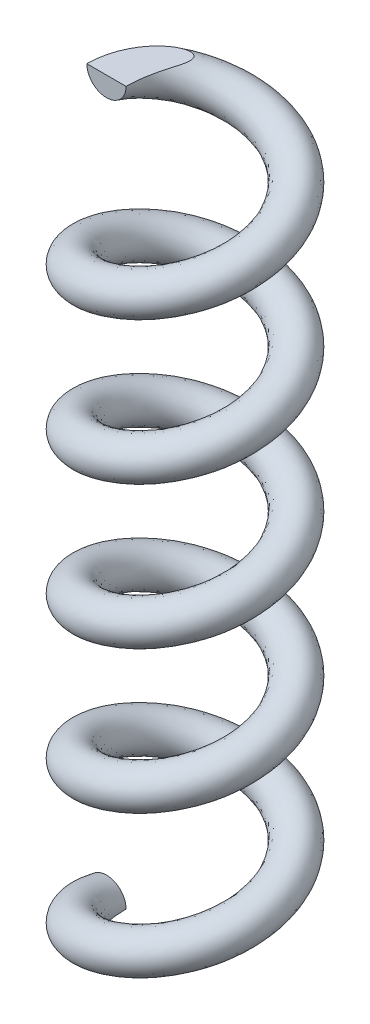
ISO-10303-21;
HEADER;
FILE_DESCRIPTION(('STEP AP214'),'2;1');
FILE_NAME('part.step','',(''),(''),'','','');
FILE_SCHEMA(('AUTOMOTIVE_DESIGN { 1 0 10303 214 1 1 1 1 }'));
ENDSEC;
DATA;
#1=APPLICATION_CONTEXT('core data for automotive mechanical design processes');
#2=APPLICATION_PROTOCOL_DEFINITION('international standard','automotive_design',2000,#1);
#3=PRODUCT_CONTEXT('',#1,'mechanical');
#4=PRODUCT('Part','Part','',(#3));
#5=PRODUCT_RELATED_PRODUCT_CATEGORY('part','',(#4));
#6=PRODUCT_DEFINITION_FORMATION('','',#4);
#7=PRODUCT_DEFINITION_CONTEXT('part definition',#1,'design');
#8=PRODUCT_DEFINITION('design','',#6,#7);
#9=PRODUCT_DEFINITION_SHAPE('','',#8);
#10=(LENGTH_UNIT() NAMED_UNIT(*) SI_UNIT(.MILLI.,.METRE.));
#11=(NAMED_UNIT(*) PLANE_ANGLE_UNIT() SI_UNIT($,.RADIAN.));
#12=(NAMED_UNIT(*) SI_UNIT($,.STERADIAN.) SOLID_ANGLE_UNIT());
#13=UNCERTAINTY_MEASURE_WITH_UNIT(LENGTH_MEASURE(1.E-05),#10,'distance_accuracy_value','');
#14=(GEOMETRIC_REPRESENTATION_CONTEXT(3) GLOBAL_UNCERTAINTY_ASSIGNED_CONTEXT((#13)) GLOBAL_UNIT_ASSIGNED_CONTEXT((#10,
#11,#12)) REPRESENTATION_CONTEXT('',''));
#15=CARTESIAN_POINT('',(0.,0.,0.));
#16=DIRECTION('',(0.,0.,1.));
#17=DIRECTION('',(1.,0.,0.));
#18=AXIS2_PLACEMENT_3D('',#15,#16,#17);
#19=CARTESIAN_POINT('',(-38.,55.4899563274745,9.77614774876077E-13));
#20=DIRECTION('',(0.,0.,1.));
#21=DIRECTION('',(1.,0.,0.));
#22=AXIS2_PLACEMENT_3D('',#19,#20,#21);
#23=PLANE('',#22);
#24=CARTESIAN_POINT('',(-38.,55.4899563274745,9.77614774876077E-13));
#25=DIRECTION('',(0.,0.,1.));
#26=DIRECTION('',(1.,0.,0.));
#27=AXIS2_PLACEMENT_3D('',#24,#25,#26);
#28=CIRCLE('',#27,3.5);
#29=CARTESIAN_POINT('',(-41.5,55.4899558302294,0.));
#30=VERTEX_POINT('',#29);
#31=CARTESIAN_POINT('',(-34.5,55.4899558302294,7.3321108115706E-13));
#32=VERTEX_POINT('',#31);
#33=EDGE_CURVE('E73',#30,#32,#28,.T.);
#34=ORIENTED_EDGE('',*,*,#33,.T.);
#35=DIRECTION('',(-1.,0.,0.));
#36=VECTOR('',#35,1.);
#37=CARTESIAN_POINT('',(-38.,55.4899558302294,9.77614774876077E-13));
#38=LINE('',#37,#36);
#39=EDGE_CURVE('E63',#32,#30,#38,.T.);
#40=ORIENTED_EDGE('',*,*,#39,.T.);
#41=EDGE_LOOP('',(#34,#40));
#42=FACE_BOUND('',#41,.T.);
#43=ADVANCED_FACE('F41',(#42),#23,.T.);
#44=CARTESIAN_POINT('',(-34.5,-71.5,0.));
#45=CARTESIAN_POINT('',(-34.5,-70.2301004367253,3.41165681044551));
#46=CARTESIAN_POINT('',(-32.4946784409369,-68.9602008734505,6.17174514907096));
#47=CARTESIAN_POINT('',(-30.4893568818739,-67.6903013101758,8.93183348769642));
#48=CARTESIAN_POINT('',(-27.2446784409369,-66.420401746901,9.98609342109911));
#49=CARTESIAN_POINT('',(-24.,-65.1505021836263,11.0403533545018));
#50=CARTESIAN_POINT('',(-20.7553215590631,-63.8806026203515,9.98609342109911));
#51=CARTESIAN_POINT('',(-17.5106431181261,-62.6107030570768,8.93183348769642));
#52=CARTESIAN_POINT('',(-15.5053215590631,-61.3408034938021,6.17174514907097));
#53=CARTESIAN_POINT('',(-13.5,-60.0709039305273,3.41165681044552));
#54=CARTESIAN_POINT('',(-13.5,-58.8010043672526,0.));
#55=CARTESIAN_POINT('',(-13.5,-57.5311048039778,-3.41165681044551));
#56=CARTESIAN_POINT('',(-15.5053215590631,-56.2612052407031,-6.17174514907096));
#57=CARTESIAN_POINT('',(-17.5106431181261,-54.9913056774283,-8.93183348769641));
#58=CARTESIAN_POINT('',(-20.7553215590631,-53.7214061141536,-9.98609342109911));
#59=CARTESIAN_POINT('',(-24.,-52.4515065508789,-11.0403533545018));
#60=CARTESIAN_POINT('',(-27.2446784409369,-51.1816069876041,-9.98609342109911));
#61=CARTESIAN_POINT('',(-30.4893568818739,-49.9117074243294,-8.93183348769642));
#62=CARTESIAN_POINT('',(-32.4946784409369,-48.6418078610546,-6.17174514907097));
#63=CARTESIAN_POINT('',(-34.5,-47.3719082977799,-3.41165681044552));
#64=CARTESIAN_POINT('',(-34.5,-46.1020087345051,0.));
#65=CARTESIAN_POINT('',(-34.5,-44.8321091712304,3.41165681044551));
#66=CARTESIAN_POINT('',(-32.4946784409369,-43.5622096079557,6.17174514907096));
#67=CARTESIAN_POINT('',(-30.4893568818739,-42.2923100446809,8.93183348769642));
#68=CARTESIAN_POINT('',(-27.2446784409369,-41.0224104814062,9.98609342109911));
#69=CARTESIAN_POINT('',(-24.,-39.7525109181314,11.0403533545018));
#70=CARTESIAN_POINT('',(-20.7553215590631,-38.4826113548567,9.98609342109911));
#71=CARTESIAN_POINT('',(-17.5106431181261,-37.212711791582,8.93183348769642));
#72=CARTESIAN_POINT('',(-15.5053215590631,-35.9428122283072,6.17174514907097));
#73=CARTESIAN_POINT('',(-13.5,-34.6729126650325,3.41165681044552));
#74=CARTESIAN_POINT('',(-13.5,-33.4030131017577,0.));
#75=CARTESIAN_POINT('',(-13.5,-32.133113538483,-3.41165681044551));
#76=CARTESIAN_POINT('',(-15.5053215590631,-30.8632139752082,-6.17174514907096));
#77=CARTESIAN_POINT('',(-17.5106431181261,-29.5933144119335,-8.93183348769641));
#78=CARTESIAN_POINT('',(-20.7553215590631,-28.3234148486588,-9.98609342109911));
#79=CARTESIAN_POINT('',(-24.,-27.053515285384,-11.0403533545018));
#80=CARTESIAN_POINT('',(-27.2446784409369,-25.7836157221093,-9.98609342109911));
#81=CARTESIAN_POINT('',(-30.4893568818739,-24.5137161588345,-8.93183348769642));
#82=CARTESIAN_POINT('',(-32.4946784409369,-23.2438165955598,-6.17174514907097));
#83=CARTESIAN_POINT('',(-34.5,-21.9739170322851,-3.41165681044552));
#84=CARTESIAN_POINT('',(-34.5,-20.7040174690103,0.));
#85=CARTESIAN_POINT('',(-34.5,-19.4341179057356,3.41165681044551));
#86=CARTESIAN_POINT('',(-32.4946784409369,-18.1642183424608,6.17174514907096));
#87=CARTESIAN_POINT('',(-30.4893568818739,-16.8943187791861,8.93183348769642));
#88=CARTESIAN_POINT('',(-27.2446784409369,-15.6244192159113,9.98609342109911));
#89=CARTESIAN_POINT('',(-24.,-14.3545196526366,11.0403533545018));
#90=CARTESIAN_POINT('',(-20.7553215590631,-13.0846200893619,9.98609342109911));
#91=CARTESIAN_POINT('',(-17.5106431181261,-11.8147205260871,8.93183348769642));
#92=CARTESIAN_POINT('',(-15.5053215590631,-10.5448209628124,6.17174514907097));
#93=CARTESIAN_POINT('',(-13.5,-9.27492139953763,3.41165681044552));
#94=CARTESIAN_POINT('',(-13.5,-8.00502183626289,0.));
#95=CARTESIAN_POINT('',(-13.5,-6.73512227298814,-3.41165681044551));
#96=CARTESIAN_POINT('',(-15.5053215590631,-5.46522270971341,-6.17174514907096));
#97=CARTESIAN_POINT('',(-17.5106431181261,-4.19532314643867,-8.93183348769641));
#98=CARTESIAN_POINT('',(-20.7553215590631,-2.92542358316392,-9.98609342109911));
#99=CARTESIAN_POINT('',(-24.,-1.65552401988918,-11.0403533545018));
#100=CARTESIAN_POINT('',(-27.2446784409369,-0.385624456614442,-9.98609342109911));
#101=CARTESIAN_POINT('',(-30.4893568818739,0.884275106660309,-8.93183348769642));
#102=CARTESIAN_POINT('',(-32.4946784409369,2.15417466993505,-6.17174514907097));
#103=CARTESIAN_POINT('',(-34.5,3.42407423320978,-3.41165681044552));
#104=CARTESIAN_POINT('',(-34.5,4.69397379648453,0.));
#105=CARTESIAN_POINT('',(-34.5,5.96387335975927,3.41165681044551));
#106=CARTESIAN_POINT('',(-32.4946784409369,7.23377292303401,6.17174514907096));
#107=CARTESIAN_POINT('',(-30.4893568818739,8.50367248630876,8.93183348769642));
#108=CARTESIAN_POINT('',(-27.2446784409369,9.7735720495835,9.98609342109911));
#109=CARTESIAN_POINT('',(-24.,11.0434716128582,11.0403533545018));
#110=CARTESIAN_POINT('',(-20.7553215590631,12.313371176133,9.98609342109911));
#111=CARTESIAN_POINT('',(-17.5106431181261,13.5832707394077,8.93183348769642));
#112=CARTESIAN_POINT('',(-15.5053215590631,14.8531703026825,6.17174514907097));
#113=CARTESIAN_POINT('',(-13.5,16.1230698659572,3.41165681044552));
#114=CARTESIAN_POINT('',(-13.5,17.392969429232,0.));
#115=CARTESIAN_POINT('',(-13.5,18.6628689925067,-3.41165681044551));
#116=CARTESIAN_POINT('',(-15.5053215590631,19.9327685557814,-6.17174514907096));
#117=CARTESIAN_POINT('',(-17.5106431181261,21.2026681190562,-8.93183348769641));
#118=CARTESIAN_POINT('',(-20.7553215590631,22.4725676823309,-9.98609342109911));
#119=CARTESIAN_POINT('',(-24.,23.7424672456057,-11.0403533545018));
#120=CARTESIAN_POINT('',(-27.2446784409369,25.0123668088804,-9.98609342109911));
#121=CARTESIAN_POINT('',(-30.4893568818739,26.2822663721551,-8.93183348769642));
#122=CARTESIAN_POINT('',(-32.4946784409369,27.5521659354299,-6.17174514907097));
#123=CARTESIAN_POINT('',(-34.5,28.8220654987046,-3.41165681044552));
#124=CARTESIAN_POINT('',(-34.5,30.0919650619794,0.));
#125=CARTESIAN_POINT('',(-34.5,31.3618646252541,3.41165681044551));
#126=CARTESIAN_POINT('',(-32.4946784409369,32.6317641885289,6.17174514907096));
#127=CARTESIAN_POINT('',(-30.4893568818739,33.9016637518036,8.93183348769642));
#128=CARTESIAN_POINT('',(-27.2446784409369,35.1715633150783,9.98609342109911));
#129=CARTESIAN_POINT('',(-24.,36.4414628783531,11.0403533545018));
#130=CARTESIAN_POINT('',(-20.7553215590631,37.7113624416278,9.98609342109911));
#131=CARTESIAN_POINT('',(-17.5106431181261,38.9812620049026,8.93183348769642));
#132=CARTESIAN_POINT('',(-15.5053215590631,40.2511615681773,6.17174514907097));
#133=CARTESIAN_POINT('',(-13.5,41.5210611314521,3.41165681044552));
#134=CARTESIAN_POINT('',(-13.5,42.7909606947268,0.));
#135=CARTESIAN_POINT('',(-13.5,44.0608602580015,-3.41165681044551));
#136=CARTESIAN_POINT('',(-15.5053215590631,45.3307598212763,-6.17174514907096));
#137=CARTESIAN_POINT('',(-17.5106431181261,46.600659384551,-8.93183348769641));
#138=CARTESIAN_POINT('',(-20.7553215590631,47.8705589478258,-9.98609342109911));
#139=CARTESIAN_POINT('',(-24.,49.1404585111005,-11.0403533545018));
#140=CARTESIAN_POINT('',(-27.2446784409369,50.4103580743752,-9.98609342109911));
#141=CARTESIAN_POINT('',(-30.4893568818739,51.68025763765,-8.93183348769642));
#142=CARTESIAN_POINT('',(-32.4946784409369,52.9501572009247,-6.17174514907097));
#143=CARTESIAN_POINT('',(-34.5,54.2200567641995,-3.41165681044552));
#144=CARTESIAN_POINT('',(-34.5,55.4899563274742,0.));
#145=CARTESIAN_POINT('',(-34.5,-64.5,0.));
#146=CARTESIAN_POINT('',(-34.5,-63.2301004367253,3.41165681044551));
#147=CARTESIAN_POINT('',(-32.4946784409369,-61.9602008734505,6.17174514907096));
#148=CARTESIAN_POINT('',(-30.4893568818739,-60.6903013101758,8.93183348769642));
#149=CARTESIAN_POINT('',(-27.2446784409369,-59.420401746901,9.98609342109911));
#150=CARTESIAN_POINT('',(-24.,-58.1505021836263,11.0403533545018));
#151=CARTESIAN_POINT('',(-20.7553215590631,-56.8806026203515,9.98609342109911));
#152=CARTESIAN_POINT('',(-17.5106431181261,-55.6107030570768,8.93183348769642));
#153=CARTESIAN_POINT('',(-15.5053215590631,-54.340803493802,6.17174514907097));
#154=CARTESIAN_POINT('',(-13.5,-53.0709039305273,3.41165681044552));
#155=CARTESIAN_POINT('',(-13.5,-51.8010043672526,0.));
#156=CARTESIAN_POINT('',(-13.5,-50.5311048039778,-3.41165681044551));
#157=CARTESIAN_POINT('',(-15.5053215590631,-49.2612052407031,-6.17174514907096));
#158=CARTESIAN_POINT('',(-17.5106431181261,-47.9913056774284,-8.93183348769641));
#159=CARTESIAN_POINT('',(-20.7553215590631,-46.7214061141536,-9.98609342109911));
#160=CARTESIAN_POINT('',(-24.,-45.4515065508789,-11.0403533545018));
#161=CARTESIAN_POINT('',(-27.2446784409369,-44.1816069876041,-9.98609342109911));
#162=CARTESIAN_POINT('',(-30.4893568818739,-42.9117074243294,-8.93183348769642));
#163=CARTESIAN_POINT('',(-32.4946784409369,-41.6418078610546,-6.17174514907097));
#164=CARTESIAN_POINT('',(-34.5,-40.3719082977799,-3.41165681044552));
#165=CARTESIAN_POINT('',(-34.5,-39.1020087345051,0.));
#166=CARTESIAN_POINT('',(-34.5,-37.8321091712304,3.41165681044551));
#167=CARTESIAN_POINT('',(-32.4946784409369,-36.5622096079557,6.17174514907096));
#168=CARTESIAN_POINT('',(-30.4893568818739,-35.2923100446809,8.93183348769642));
#169=CARTESIAN_POINT('',(-27.2446784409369,-34.0224104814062,9.98609342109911));
#170=CARTESIAN_POINT('',(-24.,-32.7525109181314,11.0403533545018));
#171=CARTESIAN_POINT('',(-20.7553215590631,-31.4826113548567,9.98609342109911));
#172=CARTESIAN_POINT('',(-17.5106431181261,-30.212711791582,8.93183348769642));
#173=CARTESIAN_POINT('',(-15.5053215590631,-28.9428122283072,6.17174514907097));
#174=CARTESIAN_POINT('',(-13.5,-27.6729126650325,3.41165681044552));
#175=CARTESIAN_POINT('',(-13.5,-26.4030131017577,0.));
#176=CARTESIAN_POINT('',(-13.5,-25.133113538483,-3.41165681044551));
#177=CARTESIAN_POINT('',(-15.5053215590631,-23.8632139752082,-6.17174514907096));
#178=CARTESIAN_POINT('',(-17.5106431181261,-22.5933144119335,-8.93183348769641));
#179=CARTESIAN_POINT('',(-20.7553215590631,-21.3234148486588,-9.98609342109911));
#180=CARTESIAN_POINT('',(-24.,-20.053515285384,-11.0403533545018));
#181=CARTESIAN_POINT('',(-27.2446784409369,-18.7836157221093,-9.98609342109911));
#182=CARTESIAN_POINT('',(-30.4893568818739,-17.5137161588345,-8.93183348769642));
#183=CARTESIAN_POINT('',(-32.4946784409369,-16.2438165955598,-6.17174514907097));
#184=CARTESIAN_POINT('',(-34.5,-14.973917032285,-3.41165681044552));
#185=CARTESIAN_POINT('',(-34.5,-13.7040174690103,0.));
#186=CARTESIAN_POINT('',(-34.5,-12.4341179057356,3.41165681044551));
#187=CARTESIAN_POINT('',(-32.4946784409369,-11.1642183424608,6.17174514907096));
#188=CARTESIAN_POINT('',(-30.4893568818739,-9.89431877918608,8.93183348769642));
#189=CARTESIAN_POINT('',(-27.2446784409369,-8.62441921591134,9.98609342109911));
#190=CARTESIAN_POINT('',(-24.,-7.3545196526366,11.0403533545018));
#191=CARTESIAN_POINT('',(-20.7553215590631,-6.08462008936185,9.98609342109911));
#192=CARTESIAN_POINT('',(-17.5106431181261,-4.81472052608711,8.93183348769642));
#193=CARTESIAN_POINT('',(-15.5053215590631,-3.54482096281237,6.17174514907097));
#194=CARTESIAN_POINT('',(-13.5,-2.27492139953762,3.41165681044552));
#195=CARTESIAN_POINT('',(-13.5,-1.00502183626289,0.));
#196=CARTESIAN_POINT('',(-13.5,0.264877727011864,-3.41165681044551));
#197=CARTESIAN_POINT('',(-15.5053215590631,1.5347772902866,-6.17174514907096));
#198=CARTESIAN_POINT('',(-17.5106431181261,2.80467685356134,-8.93183348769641));
#199=CARTESIAN_POINT('',(-20.7553215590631,4.07457641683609,-9.98609342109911));
#200=CARTESIAN_POINT('',(-24.,5.34447598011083,-11.0403533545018));
#201=CARTESIAN_POINT('',(-27.2446784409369,6.61437554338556,-9.98609342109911));
#202=CARTESIAN_POINT('',(-30.4893568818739,7.88427510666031,-8.93183348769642));
#203=CARTESIAN_POINT('',(-32.4946784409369,9.15417466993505,-6.17174514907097));
#204=CARTESIAN_POINT('',(-34.5,10.4240742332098,-3.41165681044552));
#205=CARTESIAN_POINT('',(-34.5,11.6939737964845,0.));
#206=CARTESIAN_POINT('',(-34.5,12.9638733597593,3.41165681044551));
#207=CARTESIAN_POINT('',(-32.4946784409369,14.233772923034,6.17174514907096));
#208=CARTESIAN_POINT('',(-30.4893568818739,15.5036724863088,8.93183348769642));
#209=CARTESIAN_POINT('',(-27.2446784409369,16.7735720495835,9.98609342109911));
#210=CARTESIAN_POINT('',(-24.,18.0434716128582,11.0403533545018));
#211=CARTESIAN_POINT('',(-20.7553215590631,19.313371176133,9.98609342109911));
#212=CARTESIAN_POINT('',(-17.5106431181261,20.5832707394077,8.93183348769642));
#213=CARTESIAN_POINT('',(-15.5053215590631,21.8531703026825,6.17174514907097));
#214=CARTESIAN_POINT('',(-13.5,23.1230698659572,3.41165681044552));
#215=CARTESIAN_POINT('',(-13.5,24.392969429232,0.));
#216=CARTESIAN_POINT('',(-13.5,25.6628689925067,-3.41165681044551));
#217=CARTESIAN_POINT('',(-15.5053215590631,26.9327685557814,-6.17174514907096));
#218=CARTESIAN_POINT('',(-17.5106431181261,28.2026681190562,-8.93183348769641));
#219=CARTESIAN_POINT('',(-20.7553215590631,29.4725676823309,-9.98609342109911));
#220=CARTESIAN_POINT('',(-24.,30.7424672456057,-11.0403533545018));
#221=CARTESIAN_POINT('',(-27.2446784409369,32.0123668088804,-9.98609342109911));
#222=CARTESIAN_POINT('',(-30.4893568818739,33.2822663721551,-8.93183348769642));
#223=CARTESIAN_POINT('',(-32.4946784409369,34.5521659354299,-6.17174514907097));
#224=CARTESIAN_POINT('',(-34.5,35.8220654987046,-3.41165681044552));
#225=CARTESIAN_POINT('',(-34.5,37.0919650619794,0.));
#226=CARTESIAN_POINT('',(-34.5,38.3618646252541,3.41165681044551));
#227=CARTESIAN_POINT('',(-32.4946784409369,39.6317641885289,6.17174514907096));
#228=CARTESIAN_POINT('',(-30.4893568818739,40.9016637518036,8.93183348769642));
#229=CARTESIAN_POINT('',(-27.2446784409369,42.1715633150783,9.98609342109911));
#230=CARTESIAN_POINT('',(-24.,43.4414628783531,11.0403533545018));
#231=CARTESIAN_POINT('',(-20.7553215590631,44.7113624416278,9.98609342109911));
#232=CARTESIAN_POINT('',(-17.5106431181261,45.9812620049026,8.93183348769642));
#233=CARTESIAN_POINT('',(-15.5053215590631,47.2511615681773,6.17174514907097));
#234=CARTESIAN_POINT('',(-13.5,48.5210611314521,3.41165681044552));
#235=CARTESIAN_POINT('',(-13.5,49.7909606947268,0.));
#236=CARTESIAN_POINT('',(-13.5,51.0608602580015,-3.41165681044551));
#237=CARTESIAN_POINT('',(-15.5053215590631,52.3307598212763,-6.17174514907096));
#238=CARTESIAN_POINT('',(-17.5106431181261,53.600659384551,-8.93183348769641));
#239=CARTESIAN_POINT('',(-20.7553215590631,54.8705589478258,-9.98609342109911));
#240=CARTESIAN_POINT('',(-24.,56.1404585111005,-11.0403533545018));
#241=CARTESIAN_POINT('',(-27.2446784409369,57.4103580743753,-9.98609342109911));
#242=CARTESIAN_POINT('',(-30.4893568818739,58.68025763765,-8.93183348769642));
#243=CARTESIAN_POINT('',(-32.4946784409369,59.9501572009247,-6.17174514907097));
#244=CARTESIAN_POINT('',(-34.5,61.2200567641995,-3.41165681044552));
#245=CARTESIAN_POINT('',(-34.5,62.4899563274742,0.));
#246=CARTESIAN_POINT('',(-41.5,-64.5,0.));
#247=CARTESIAN_POINT('',(-41.5,-63.2301004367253,5.68609468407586));
#248=CARTESIAN_POINT('',(-38.1577974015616,-61.9602008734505,10.2862419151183));
#249=CARTESIAN_POINT('',(-34.8155948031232,-60.6903013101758,14.8863891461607));
#250=CARTESIAN_POINT('',(-29.4077974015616,-59.420401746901,16.6434890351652));
#251=CARTESIAN_POINT('',(-24.,-58.1505021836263,18.4005889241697));
#252=CARTESIAN_POINT('',(-18.5922025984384,-56.8806026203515,16.6434890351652));
#253=CARTESIAN_POINT('',(-13.1844051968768,-55.6107030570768,14.8863891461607));
#254=CARTESIAN_POINT('',(-9.84220259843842,-54.340803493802,10.2862419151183));
#255=CARTESIAN_POINT('',(-6.5,-53.0709039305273,5.68609468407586));
#256=CARTESIAN_POINT('',(-6.5,-51.8010043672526,0.));
#257=CARTESIAN_POINT('',(-6.5,-50.5311048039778,-5.68609468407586));
#258=CARTESIAN_POINT('',(-9.84220259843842,-49.2612052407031,-10.2862419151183));
#259=CARTESIAN_POINT('',(-13.1844051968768,-47.9913056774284,-14.8863891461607));
#260=CARTESIAN_POINT('',(-18.5922025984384,-46.7214061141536,-16.6434890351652));
#261=CARTESIAN_POINT('',(-24.,-45.4515065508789,-18.4005889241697));
#262=CARTESIAN_POINT('',(-29.4077974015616,-44.1816069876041,-16.6434890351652));
#263=CARTESIAN_POINT('',(-34.8155948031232,-42.9117074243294,-14.8863891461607));
#264=CARTESIAN_POINT('',(-38.1577974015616,-41.6418078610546,-10.2862419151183));
#265=CARTESIAN_POINT('',(-41.5,-40.3719082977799,-5.68609468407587));
#266=CARTESIAN_POINT('',(-41.5,-39.1020087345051,0.));
#267=CARTESIAN_POINT('',(-41.5,-37.8321091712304,5.68609468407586));
#268=CARTESIAN_POINT('',(-38.1577974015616,-36.5622096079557,10.2862419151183));
#269=CARTESIAN_POINT('',(-34.8155948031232,-35.2923100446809,14.8863891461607));
#270=CARTESIAN_POINT('',(-29.4077974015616,-34.0224104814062,16.6434890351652));
#271=CARTESIAN_POINT('',(-24.,-32.7525109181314,18.4005889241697));
#272=CARTESIAN_POINT('',(-18.5922025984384,-31.4826113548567,16.6434890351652));
#273=CARTESIAN_POINT('',(-13.1844051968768,-30.212711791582,14.8863891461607));
#274=CARTESIAN_POINT('',(-9.84220259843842,-28.9428122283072,10.2862419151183));
#275=CARTESIAN_POINT('',(-6.5,-27.6729126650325,5.68609468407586));
#276=CARTESIAN_POINT('',(-6.5,-26.4030131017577,0.));
#277=CARTESIAN_POINT('',(-6.5,-25.133113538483,-5.68609468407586));
#278=CARTESIAN_POINT('',(-9.84220259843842,-23.8632139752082,-10.2862419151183));
#279=CARTESIAN_POINT('',(-13.1844051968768,-22.5933144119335,-14.8863891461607));
#280=CARTESIAN_POINT('',(-18.5922025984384,-21.3234148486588,-16.6434890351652));
#281=CARTESIAN_POINT('',(-24.,-20.053515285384,-18.4005889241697));
#282=CARTESIAN_POINT('',(-29.4077974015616,-18.7836157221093,-16.6434890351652));
#283=CARTESIAN_POINT('',(-34.8155948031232,-17.5137161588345,-14.8863891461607));
#284=CARTESIAN_POINT('',(-38.1577974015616,-16.2438165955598,-10.2862419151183));
#285=CARTESIAN_POINT('',(-41.5,-14.973917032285,-5.68609468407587));
#286=CARTESIAN_POINT('',(-41.5,-13.7040174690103,0.));
#287=CARTESIAN_POINT('',(-41.5,-12.4341179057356,5.68609468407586));
#288=CARTESIAN_POINT('',(-38.1577974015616,-11.1642183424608,10.2862419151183));
#289=CARTESIAN_POINT('',(-34.8155948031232,-9.89431877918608,14.8863891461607));
#290=CARTESIAN_POINT('',(-29.4077974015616,-8.62441921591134,16.6434890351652));
#291=CARTESIAN_POINT('',(-24.,-7.3545196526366,18.4005889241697));
#292=CARTESIAN_POINT('',(-18.5922025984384,-6.08462008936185,16.6434890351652));
#293=CARTESIAN_POINT('',(-13.1844051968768,-4.81472052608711,14.8863891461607));
#294=CARTESIAN_POINT('',(-9.84220259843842,-3.54482096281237,10.2862419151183));
#295=CARTESIAN_POINT('',(-6.5,-2.27492139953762,5.68609468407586));
#296=CARTESIAN_POINT('',(-6.5,-1.00502183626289,0.));
#297=CARTESIAN_POINT('',(-6.5,0.264877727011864,-5.68609468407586));
#298=CARTESIAN_POINT('',(-9.84220259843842,1.5347772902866,-10.2862419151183));
#299=CARTESIAN_POINT('',(-13.1844051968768,2.80467685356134,-14.8863891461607));
#300=CARTESIAN_POINT('',(-18.5922025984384,4.07457641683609,-16.6434890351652));
#301=CARTESIAN_POINT('',(-24.,5.34447598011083,-18.4005889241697));
#302=CARTESIAN_POINT('',(-29.4077974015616,6.61437554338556,-16.6434890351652));
#303=CARTESIAN_POINT('',(-34.8155948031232,7.88427510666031,-14.8863891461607));
#304=CARTESIAN_POINT('',(-38.1577974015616,9.15417466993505,-10.2862419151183));
#305=CARTESIAN_POINT('',(-41.5,10.4240742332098,-5.68609468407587));
#306=CARTESIAN_POINT('',(-41.5,11.6939737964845,0.));
#307=CARTESIAN_POINT('',(-41.5,12.9638733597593,5.68609468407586));
#308=CARTESIAN_POINT('',(-38.1577974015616,14.233772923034,10.2862419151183));
#309=CARTESIAN_POINT('',(-34.8155948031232,15.5036724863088,14.8863891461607));
#310=CARTESIAN_POINT('',(-29.4077974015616,16.7735720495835,16.6434890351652));
#311=CARTESIAN_POINT('',(-24.,18.0434716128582,18.4005889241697));
#312=CARTESIAN_POINT('',(-18.5922025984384,19.313371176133,16.6434890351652));
#313=CARTESIAN_POINT('',(-13.1844051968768,20.5832707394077,14.8863891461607));
#314=CARTESIAN_POINT('',(-9.84220259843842,21.8531703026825,10.2862419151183));
#315=CARTESIAN_POINT('',(-6.5,23.1230698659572,5.68609468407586));
#316=CARTESIAN_POINT('',(-6.5,24.392969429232,0.));
#317=CARTESIAN_POINT('',(-6.5,25.6628689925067,-5.68609468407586));
#318=CARTESIAN_POINT('',(-9.84220259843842,26.9327685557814,-10.2862419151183));
#319=CARTESIAN_POINT('',(-13.1844051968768,28.2026681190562,-14.8863891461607));
#320=CARTESIAN_POINT('',(-18.5922025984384,29.4725676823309,-16.6434890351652));
#321=CARTESIAN_POINT('',(-24.,30.7424672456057,-18.4005889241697));
#322=CARTESIAN_POINT('',(-29.4077974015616,32.0123668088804,-16.6434890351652));
#323=CARTESIAN_POINT('',(-34.8155948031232,33.2822663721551,-14.8863891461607));
#324=CARTESIAN_POINT('',(-38.1577974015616,34.5521659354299,-10.2862419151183));
#325=CARTESIAN_POINT('',(-41.5,35.8220654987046,-5.68609468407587));
#326=CARTESIAN_POINT('',(-41.5,37.0919650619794,0.));
#327=CARTESIAN_POINT('',(-41.5,38.3618646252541,5.68609468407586));
#328=CARTESIAN_POINT('',(-38.1577974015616,39.6317641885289,10.2862419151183));
#329=CARTESIAN_POINT('',(-34.8155948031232,40.9016637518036,14.8863891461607));
#330=CARTESIAN_POINT('',(-29.4077974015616,42.1715633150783,16.6434890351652));
#331=CARTESIAN_POINT('',(-24.,43.4414628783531,18.4005889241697));
#332=CARTESIAN_POINT('',(-18.5922025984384,44.7113624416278,16.6434890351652));
#333=CARTESIAN_POINT('',(-13.1844051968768,45.9812620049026,14.8863891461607));
#334=CARTESIAN_POINT('',(-9.84220259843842,47.2511615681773,10.2862419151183));
#335=CARTESIAN_POINT('',(-6.5,48.5210611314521,5.68609468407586));
#336=CARTESIAN_POINT('',(-6.5,49.7909606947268,0.));
#337=CARTESIAN_POINT('',(-6.5,51.0608602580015,-5.68609468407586));
#338=CARTESIAN_POINT('',(-9.84220259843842,52.3307598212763,-10.2862419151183));
#339=CARTESIAN_POINT('',(-13.1844051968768,53.600659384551,-14.8863891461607));
#340=CARTESIAN_POINT('',(-18.5922025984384,54.8705589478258,-16.6434890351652));
#341=CARTESIAN_POINT('',(-24.,56.1404585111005,-18.4005889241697));
#342=CARTESIAN_POINT('',(-29.4077974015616,57.4103580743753,-16.6434890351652));
#343=CARTESIAN_POINT('',(-34.8155948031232,58.68025763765,-14.8863891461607));
#344=CARTESIAN_POINT('',(-38.1577974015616,59.9501572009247,-10.2862419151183));
#345=CARTESIAN_POINT('',(-41.5,61.2200567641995,-5.68609468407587));
#346=CARTESIAN_POINT('',(-41.5,62.4899563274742,0.));
#347=CARTESIAN_POINT('',(-41.5,-71.5,0.));
#348=CARTESIAN_POINT('',(-41.5,-70.2301004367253,5.68609468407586));
#349=CARTESIAN_POINT('',(-38.1577974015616,-68.9602008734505,10.2862419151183));
#350=CARTESIAN_POINT('',(-34.8155948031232,-67.6903013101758,14.8863891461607));
#351=CARTESIAN_POINT('',(-29.4077974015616,-66.420401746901,16.6434890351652));
#352=CARTESIAN_POINT('',(-24.,-65.1505021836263,18.4005889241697));
#353=CARTESIAN_POINT('',(-18.5922025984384,-63.8806026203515,16.6434890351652));
#354=CARTESIAN_POINT('',(-13.1844051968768,-62.6107030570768,14.8863891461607));
#355=CARTESIAN_POINT('',(-9.84220259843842,-61.3408034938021,10.2862419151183));
#356=CARTESIAN_POINT('',(-6.5,-60.0709039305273,5.68609468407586));
#357=CARTESIAN_POINT('',(-6.5,-58.8010043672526,0.));
#358=CARTESIAN_POINT('',(-6.5,-57.5311048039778,-5.68609468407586));
#359=CARTESIAN_POINT('',(-9.84220259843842,-56.2612052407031,-10.2862419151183));
#360=CARTESIAN_POINT('',(-13.1844051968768,-54.9913056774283,-14.8863891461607));
#361=CARTESIAN_POINT('',(-18.5922025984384,-53.7214061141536,-16.6434890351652));
#362=CARTESIAN_POINT('',(-24.,-52.4515065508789,-18.4005889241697));
#363=CARTESIAN_POINT('',(-29.4077974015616,-51.1816069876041,-16.6434890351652));
#364=CARTESIAN_POINT('',(-34.8155948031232,-49.9117074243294,-14.8863891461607));
#365=CARTESIAN_POINT('',(-38.1577974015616,-48.6418078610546,-10.2862419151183));
#366=CARTESIAN_POINT('',(-41.5,-47.3719082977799,-5.68609468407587));
#367=CARTESIAN_POINT('',(-41.5,-46.1020087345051,0.));
#368=CARTESIAN_POINT('',(-41.5,-44.8321091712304,5.68609468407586));
#369=CARTESIAN_POINT('',(-38.1577974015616,-43.5622096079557,10.2862419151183));
#370=CARTESIAN_POINT('',(-34.8155948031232,-42.2923100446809,14.8863891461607));
#371=CARTESIAN_POINT('',(-29.4077974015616,-41.0224104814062,16.6434890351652));
#372=CARTESIAN_POINT('',(-24.,-39.7525109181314,18.4005889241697));
#373=CARTESIAN_POINT('',(-18.5922025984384,-38.4826113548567,16.6434890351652));
#374=CARTESIAN_POINT('',(-13.1844051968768,-37.212711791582,14.8863891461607));
#375=CARTESIAN_POINT('',(-9.84220259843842,-35.9428122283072,10.2862419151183));
#376=CARTESIAN_POINT('',(-6.5,-34.6729126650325,5.68609468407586));
#377=CARTESIAN_POINT('',(-6.5,-33.4030131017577,0.));
#378=CARTESIAN_POINT('',(-6.5,-32.133113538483,-5.68609468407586));
#379=CARTESIAN_POINT('',(-9.84220259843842,-30.8632139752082,-10.2862419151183));
#380=CARTESIAN_POINT('',(-13.1844051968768,-29.5933144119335,-14.8863891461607));
#381=CARTESIAN_POINT('',(-18.5922025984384,-28.3234148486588,-16.6434890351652));
#382=CARTESIAN_POINT('',(-24.,-27.053515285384,-18.4005889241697));
#383=CARTESIAN_POINT('',(-29.4077974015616,-25.7836157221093,-16.6434890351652));
#384=CARTESIAN_POINT('',(-34.8155948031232,-24.5137161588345,-14.8863891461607));
#385=CARTESIAN_POINT('',(-38.1577974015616,-23.2438165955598,-10.2862419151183));
#386=CARTESIAN_POINT('',(-41.5,-21.9739170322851,-5.68609468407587));
#387=CARTESIAN_POINT('',(-41.5,-20.7040174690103,0.));
#388=CARTESIAN_POINT('',(-41.5,-19.4341179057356,5.68609468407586));
#389=CARTESIAN_POINT('',(-38.1577974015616,-18.1642183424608,10.2862419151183));
#390=CARTESIAN_POINT('',(-34.8155948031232,-16.8943187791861,14.8863891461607));
#391=CARTESIAN_POINT('',(-29.4077974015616,-15.6244192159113,16.6434890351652));
#392=CARTESIAN_POINT('',(-24.,-14.3545196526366,18.4005889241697));
#393=CARTESIAN_POINT('',(-18.5922025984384,-13.0846200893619,16.6434890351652));
#394=CARTESIAN_POINT('',(-13.1844051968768,-11.8147205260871,14.8863891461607));
#395=CARTESIAN_POINT('',(-9.84220259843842,-10.5448209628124,10.2862419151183));
#396=CARTESIAN_POINT('',(-6.5,-9.27492139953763,5.68609468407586));
#397=CARTESIAN_POINT('',(-6.5,-8.00502183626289,0.));
#398=CARTESIAN_POINT('',(-6.5,-6.73512227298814,-5.68609468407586));
#399=CARTESIAN_POINT('',(-9.84220259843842,-5.46522270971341,-10.2862419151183));
#400=CARTESIAN_POINT('',(-13.1844051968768,-4.19532314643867,-14.8863891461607));
#401=CARTESIAN_POINT('',(-18.5922025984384,-2.92542358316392,-16.6434890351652));
#402=CARTESIAN_POINT('',(-24.,-1.65552401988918,-18.4005889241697));
#403=CARTESIAN_POINT('',(-29.4077974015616,-0.385624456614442,-16.6434890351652));
#404=CARTESIAN_POINT('',(-34.8155948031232,0.884275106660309,-14.8863891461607));
#405=CARTESIAN_POINT('',(-38.1577974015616,2.15417466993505,-10.2862419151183));
#406=CARTESIAN_POINT('',(-41.5,3.42407423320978,-5.68609468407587));
#407=CARTESIAN_POINT('',(-41.5,4.69397379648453,0.));
#408=CARTESIAN_POINT('',(-41.5,5.96387335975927,5.68609468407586));
#409=CARTESIAN_POINT('',(-38.1577974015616,7.23377292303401,10.2862419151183));
#410=CARTESIAN_POINT('',(-34.8155948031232,8.50367248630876,14.8863891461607));
#411=CARTESIAN_POINT('',(-29.4077974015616,9.7735720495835,16.6434890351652));
#412=CARTESIAN_POINT('',(-24.,11.0434716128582,18.4005889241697));
#413=CARTESIAN_POINT('',(-18.5922025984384,12.313371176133,16.6434890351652));
#414=CARTESIAN_POINT('',(-13.1844051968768,13.5832707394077,14.8863891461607));
#415=CARTESIAN_POINT('',(-9.84220259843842,14.8531703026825,10.2862419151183));
#416=CARTESIAN_POINT('',(-6.5,16.1230698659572,5.68609468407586));
#417=CARTESIAN_POINT('',(-6.5,17.392969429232,0.));
#418=CARTESIAN_POINT('',(-6.5,18.6628689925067,-5.68609468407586));
#419=CARTESIAN_POINT('',(-9.84220259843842,19.9327685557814,-10.2862419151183));
#420=CARTESIAN_POINT('',(-13.1844051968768,21.2026681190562,-14.8863891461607));
#421=CARTESIAN_POINT('',(-18.5922025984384,22.4725676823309,-16.6434890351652));
#422=CARTESIAN_POINT('',(-24.,23.7424672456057,-18.4005889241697));
#423=CARTESIAN_POINT('',(-29.4077974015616,25.0123668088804,-16.6434890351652));
#424=CARTESIAN_POINT('',(-34.8155948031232,26.2822663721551,-14.8863891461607));
#425=CARTESIAN_POINT('',(-38.1577974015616,27.5521659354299,-10.2862419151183));
#426=CARTESIAN_POINT('',(-41.5,28.8220654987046,-5.68609468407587));
#427=CARTESIAN_POINT('',(-41.5,30.0919650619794,0.));
#428=CARTESIAN_POINT('',(-41.5,31.3618646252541,5.68609468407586));
#429=CARTESIAN_POINT('',(-38.1577974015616,32.6317641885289,10.2862419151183));
#430=CARTESIAN_POINT('',(-34.8155948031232,33.9016637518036,14.8863891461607));
#431=CARTESIAN_POINT('',(-29.4077974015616,35.1715633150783,16.6434890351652));
#432=CARTESIAN_POINT('',(-24.,36.4414628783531,18.4005889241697));
#433=CARTESIAN_POINT('',(-18.5922025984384,37.7113624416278,16.6434890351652));
#434=CARTESIAN_POINT('',(-13.1844051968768,38.9812620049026,14.8863891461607));
#435=CARTESIAN_POINT('',(-9.84220259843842,40.2511615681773,10.2862419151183));
#436=CARTESIAN_POINT('',(-6.5,41.5210611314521,5.68609468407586));
#437=CARTESIAN_POINT('',(-6.5,42.7909606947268,0.));
#438=CARTESIAN_POINT('',(-6.5,44.0608602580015,-5.68609468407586));
#439=CARTESIAN_POINT('',(-9.84220259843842,45.3307598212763,-10.2862419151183));
#440=CARTESIAN_POINT('',(-13.1844051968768,46.600659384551,-14.8863891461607));
#441=CARTESIAN_POINT('',(-18.5922025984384,47.8705589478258,-16.6434890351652));
#442=CARTESIAN_POINT('',(-24.,49.1404585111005,-18.4005889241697));
#443=CARTESIAN_POINT('',(-29.4077974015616,50.4103580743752,-16.6434890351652));
#444=CARTESIAN_POINT('',(-34.8155948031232,51.68025763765,-14.8863891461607));
#445=CARTESIAN_POINT('',(-38.1577974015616,52.9501572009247,-10.2862419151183));
#446=CARTESIAN_POINT('',(-41.5,54.2200567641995,-5.68609468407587));
#447=CARTESIAN_POINT('',(-41.5,55.4899563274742,0.));
#448=CARTESIAN_POINT('',(-41.5,-78.5,0.));
#449=CARTESIAN_POINT('',(-41.5,-77.2301004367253,5.68609468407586));
#450=CARTESIAN_POINT('',(-38.1577974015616,-75.9602008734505,10.2862419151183));
#451=CARTESIAN_POINT('',(-34.8155948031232,-74.6903013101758,14.8863891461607));
#452=CARTESIAN_POINT('',(-29.4077974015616,-73.420401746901,16.6434890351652));
#453=CARTESIAN_POINT('',(-24.,-72.1505021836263,18.4005889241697));
#454=CARTESIAN_POINT('',(-18.5922025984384,-70.8806026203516,16.6434890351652));
#455=CARTESIAN_POINT('',(-13.1844051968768,-69.6107030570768,14.8863891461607));
#456=CARTESIAN_POINT('',(-9.84220259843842,-68.3408034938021,10.2862419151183));
#457=CARTESIAN_POINT('',(-6.5,-67.0709039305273,5.68609468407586));
#458=CARTESIAN_POINT('',(-6.5,-65.8010043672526,0.));
#459=CARTESIAN_POINT('',(-6.5,-64.5311048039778,-5.68609468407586));
#460=CARTESIAN_POINT('',(-9.84220259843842,-63.2612052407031,-10.2862419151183));
#461=CARTESIAN_POINT('',(-13.1844051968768,-61.9913056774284,-14.8863891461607));
#462=CARTESIAN_POINT('',(-18.5922025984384,-60.7214061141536,-16.6434890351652));
#463=CARTESIAN_POINT('',(-24.,-59.4515065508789,-18.4005889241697));
#464=CARTESIAN_POINT('',(-29.4077974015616,-58.1816069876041,-16.6434890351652));
#465=CARTESIAN_POINT('',(-34.8155948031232,-56.9117074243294,-14.8863891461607));
#466=CARTESIAN_POINT('',(-38.1577974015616,-55.6418078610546,-10.2862419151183));
#467=CARTESIAN_POINT('',(-41.5,-54.3719082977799,-5.68609468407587));
#468=CARTESIAN_POINT('',(-41.5,-53.1020087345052,0.));
#469=CARTESIAN_POINT('',(-41.5,-51.8321091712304,5.68609468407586));
#470=CARTESIAN_POINT('',(-38.1577974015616,-50.5622096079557,10.2862419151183));
#471=CARTESIAN_POINT('',(-34.8155948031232,-49.2923100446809,14.8863891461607));
#472=CARTESIAN_POINT('',(-29.4077974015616,-48.0224104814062,16.6434890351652));
#473=CARTESIAN_POINT('',(-24.,-46.7525109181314,18.4005889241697));
#474=CARTESIAN_POINT('',(-18.5922025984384,-45.4826113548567,16.6434890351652));
#475=CARTESIAN_POINT('',(-13.1844051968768,-44.212711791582,14.8863891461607));
#476=CARTESIAN_POINT('',(-9.84220259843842,-42.9428122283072,10.2862419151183));
#477=CARTESIAN_POINT('',(-6.5,-41.6729126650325,5.68609468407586));
#478=CARTESIAN_POINT('',(-6.5,-40.4030131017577,0.));
#479=CARTESIAN_POINT('',(-6.5,-39.133113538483,-5.68609468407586));
#480=CARTESIAN_POINT('',(-9.84220259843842,-37.8632139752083,-10.2862419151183));
#481=CARTESIAN_POINT('',(-13.1844051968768,-36.5933144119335,-14.8863891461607));
#482=CARTESIAN_POINT('',(-18.5922025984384,-35.3234148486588,-16.6434890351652));
#483=CARTESIAN_POINT('',(-24.,-34.053515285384,-18.4005889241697));
#484=CARTESIAN_POINT('',(-29.4077974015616,-32.7836157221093,-16.6434890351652));
#485=CARTESIAN_POINT('',(-34.8155948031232,-31.5137161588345,-14.8863891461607));
#486=CARTESIAN_POINT('',(-38.1577974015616,-30.2438165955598,-10.2862419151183));
#487=CARTESIAN_POINT('',(-41.5,-28.9739170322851,-5.68609468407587));
#488=CARTESIAN_POINT('',(-41.5,-27.7040174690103,0.));
#489=CARTESIAN_POINT('',(-41.5,-26.4341179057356,5.68609468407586));
#490=CARTESIAN_POINT('',(-38.1577974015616,-25.1642183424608,10.2862419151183));
#491=CARTESIAN_POINT('',(-34.8155948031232,-23.8943187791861,14.8863891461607));
#492=CARTESIAN_POINT('',(-29.4077974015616,-22.6244192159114,16.6434890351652));
#493=CARTESIAN_POINT('',(-24.,-21.3545196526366,18.4005889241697));
#494=CARTESIAN_POINT('',(-18.5922025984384,-20.0846200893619,16.6434890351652));
#495=CARTESIAN_POINT('',(-13.1844051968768,-18.8147205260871,14.8863891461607));
#496=CARTESIAN_POINT('',(-9.84220259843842,-17.5448209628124,10.2862419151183));
#497=CARTESIAN_POINT('',(-6.5,-16.2749213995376,5.68609468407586));
#498=CARTESIAN_POINT('',(-6.5,-15.0050218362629,0.));
#499=CARTESIAN_POINT('',(-6.5,-13.7351222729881,-5.68609468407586));
#500=CARTESIAN_POINT('',(-9.84220259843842,-12.4652227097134,-10.2862419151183));
#501=CARTESIAN_POINT('',(-13.1844051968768,-11.1953231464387,-14.8863891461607));
#502=CARTESIAN_POINT('',(-18.5922025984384,-9.92542358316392,-16.6434890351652));
#503=CARTESIAN_POINT('',(-24.,-8.65552401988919,-18.4005889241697));
#504=CARTESIAN_POINT('',(-29.4077974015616,-7.38562445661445,-16.6434890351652));
#505=CARTESIAN_POINT('',(-34.8155948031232,-6.1157248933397,-14.8863891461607));
#506=CARTESIAN_POINT('',(-38.1577974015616,-4.84582533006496,-10.2862419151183));
#507=CARTESIAN_POINT('',(-41.5,-3.57592576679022,-5.68609468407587));
#508=CARTESIAN_POINT('',(-41.5,-2.30602620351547,0.));
#509=CARTESIAN_POINT('',(-41.5,-1.03612664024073,5.68609468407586));
#510=CARTESIAN_POINT('',(-38.1577974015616,0.233772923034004,10.2862419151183));
#511=CARTESIAN_POINT('',(-34.8155948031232,1.50367248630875,14.8863891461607));
#512=CARTESIAN_POINT('',(-29.4077974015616,2.77357204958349,16.6434890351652));
#513=CARTESIAN_POINT('',(-24.,4.04347161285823,18.4005889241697));
#514=CARTESIAN_POINT('',(-18.5922025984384,5.31337117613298,16.6434890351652));
#515=CARTESIAN_POINT('',(-13.1844051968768,6.58327073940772,14.8863891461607));
#516=CARTESIAN_POINT('',(-9.84220259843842,7.85317030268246,10.2862419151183));
#517=CARTESIAN_POINT('',(-6.5,9.12306986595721,5.68609468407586));
#518=CARTESIAN_POINT('',(-6.5,10.3929694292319,0.));
#519=CARTESIAN_POINT('',(-6.5,11.6628689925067,-5.68609468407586));
#520=CARTESIAN_POINT('',(-9.84220259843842,12.9327685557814,-10.2862419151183));
#521=CARTESIAN_POINT('',(-13.1844051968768,14.2026681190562,-14.8863891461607));
#522=CARTESIAN_POINT('',(-18.5922025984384,15.4725676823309,-16.6434890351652));
#523=CARTESIAN_POINT('',(-24.,16.7424672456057,-18.4005889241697));
#524=CARTESIAN_POINT('',(-29.4077974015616,18.0123668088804,-16.6434890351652));
#525=CARTESIAN_POINT('',(-34.8155948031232,19.2822663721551,-14.8863891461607));
#526=CARTESIAN_POINT('',(-38.1577974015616,20.5521659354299,-10.2862419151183));
#527=CARTESIAN_POINT('',(-41.5,21.8220654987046,-5.68609468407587));
#528=CARTESIAN_POINT('',(-41.5,23.0919650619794,0.));
#529=CARTESIAN_POINT('',(-41.5,24.3618646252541,5.68609468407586));
#530=CARTESIAN_POINT('',(-38.1577974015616,25.6317641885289,10.2862419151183));
#531=CARTESIAN_POINT('',(-34.8155948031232,26.9016637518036,14.8863891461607));
#532=CARTESIAN_POINT('',(-29.4077974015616,28.1715633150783,16.6434890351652));
#533=CARTESIAN_POINT('',(-24.,29.4414628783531,18.4005889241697));
#534=CARTESIAN_POINT('',(-18.5922025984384,30.7113624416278,16.6434890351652));
#535=CARTESIAN_POINT('',(-13.1844051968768,31.9812620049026,14.8863891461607));
#536=CARTESIAN_POINT('',(-9.84220259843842,33.2511615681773,10.2862419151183));
#537=CARTESIAN_POINT('',(-6.5,34.521061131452,5.68609468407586));
#538=CARTESIAN_POINT('',(-6.5,35.7909606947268,0.));
#539=CARTESIAN_POINT('',(-6.5,37.0608602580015,-5.68609468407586));
#540=CARTESIAN_POINT('',(-9.84220259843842,38.3307598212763,-10.2862419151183));
#541=CARTESIAN_POINT('',(-13.1844051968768,39.600659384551,-14.8863891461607));
#542=CARTESIAN_POINT('',(-18.5922025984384,40.8705589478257,-16.6434890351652));
#543=CARTESIAN_POINT('',(-24.,42.1404585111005,-18.4005889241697));
#544=CARTESIAN_POINT('',(-29.4077974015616,43.4103580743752,-16.6434890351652));
#545=CARTESIAN_POINT('',(-34.8155948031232,44.68025763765,-14.8863891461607));
#546=CARTESIAN_POINT('',(-38.1577974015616,45.9501572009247,-10.2862419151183));
#547=CARTESIAN_POINT('',(-41.5,47.2200567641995,-5.68609468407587));
#548=CARTESIAN_POINT('',(-41.5,48.4899563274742,0.));
#549=CARTESIAN_POINT('',(-34.5,-78.5,0.));
#550=CARTESIAN_POINT('',(-34.5,-77.2301004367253,3.41165681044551));
#551=CARTESIAN_POINT('',(-32.4946784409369,-75.9602008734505,6.17174514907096));
#552=CARTESIAN_POINT('',(-30.4893568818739,-74.6903013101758,8.93183348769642));
#553=CARTESIAN_POINT('',(-27.2446784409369,-73.420401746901,9.98609342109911));
#554=CARTESIAN_POINT('',(-24.,-72.1505021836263,11.0403533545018));
#555=CARTESIAN_POINT('',(-20.7553215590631,-70.8806026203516,9.98609342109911));
#556=CARTESIAN_POINT('',(-17.5106431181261,-69.6107030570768,8.93183348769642));
#557=CARTESIAN_POINT('',(-15.5053215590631,-68.3408034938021,6.17174514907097));
#558=CARTESIAN_POINT('',(-13.5,-67.0709039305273,3.41165681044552));
#559=CARTESIAN_POINT('',(-13.5,-65.8010043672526,0.));
#560=CARTESIAN_POINT('',(-13.5,-64.5311048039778,-3.41165681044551));
#561=CARTESIAN_POINT('',(-15.5053215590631,-63.2612052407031,-6.17174514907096));
#562=CARTESIAN_POINT('',(-17.5106431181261,-61.9913056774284,-8.93183348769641));
#563=CARTESIAN_POINT('',(-20.7553215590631,-60.7214061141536,-9.98609342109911));
#564=CARTESIAN_POINT('',(-24.,-59.4515065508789,-11.0403533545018));
#565=CARTESIAN_POINT('',(-27.2446784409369,-58.1816069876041,-9.98609342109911));
#566=CARTESIAN_POINT('',(-30.4893568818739,-56.9117074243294,-8.93183348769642));
#567=CARTESIAN_POINT('',(-32.4946784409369,-55.6418078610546,-6.17174514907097));
#568=CARTESIAN_POINT('',(-34.5,-54.3719082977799,-3.41165681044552));
#569=CARTESIAN_POINT('',(-34.5,-53.1020087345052,0.));
#570=CARTESIAN_POINT('',(-34.5,-51.8321091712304,3.41165681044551));
#571=CARTESIAN_POINT('',(-32.4946784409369,-50.5622096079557,6.17174514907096));
#572=CARTESIAN_POINT('',(-30.4893568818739,-49.2923100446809,8.93183348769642));
#573=CARTESIAN_POINT('',(-27.2446784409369,-48.0224104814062,9.98609342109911));
#574=CARTESIAN_POINT('',(-24.,-46.7525109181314,11.0403533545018));
#575=CARTESIAN_POINT('',(-20.7553215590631,-45.4826113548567,9.98609342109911));
#576=CARTESIAN_POINT('',(-17.5106431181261,-44.212711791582,8.93183348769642));
#577=CARTESIAN_POINT('',(-15.5053215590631,-42.9428122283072,6.17174514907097));
#578=CARTESIAN_POINT('',(-13.5,-41.6729126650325,3.41165681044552));
#579=CARTESIAN_POINT('',(-13.5,-40.4030131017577,0.));
#580=CARTESIAN_POINT('',(-13.5,-39.133113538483,-3.41165681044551));
#581=CARTESIAN_POINT('',(-15.5053215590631,-37.8632139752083,-6.17174514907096));
#582=CARTESIAN_POINT('',(-17.5106431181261,-36.5933144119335,-8.93183348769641));
#583=CARTESIAN_POINT('',(-20.7553215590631,-35.3234148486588,-9.98609342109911));
#584=CARTESIAN_POINT('',(-24.,-34.053515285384,-11.0403533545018));
#585=CARTESIAN_POINT('',(-27.2446784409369,-32.7836157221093,-9.98609342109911));
#586=CARTESIAN_POINT('',(-30.4893568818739,-31.5137161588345,-8.93183348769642));
#587=CARTESIAN_POINT('',(-32.4946784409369,-30.2438165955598,-6.17174514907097));
#588=CARTESIAN_POINT('',(-34.5,-28.9739170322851,-3.41165681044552));
#589=CARTESIAN_POINT('',(-34.5,-27.7040174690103,0.));
#590=CARTESIAN_POINT('',(-34.5,-26.4341179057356,3.41165681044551));
#591=CARTESIAN_POINT('',(-32.4946784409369,-25.1642183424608,6.17174514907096));
#592=CARTESIAN_POINT('',(-30.4893568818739,-23.8943187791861,8.93183348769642));
#593=CARTESIAN_POINT('',(-27.2446784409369,-22.6244192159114,9.98609342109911));
#594=CARTESIAN_POINT('',(-24.,-21.3545196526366,11.0403533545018));
#595=CARTESIAN_POINT('',(-20.7553215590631,-20.0846200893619,9.98609342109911));
#596=CARTESIAN_POINT('',(-17.5106431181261,-18.8147205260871,8.93183348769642));
#597=CARTESIAN_POINT('',(-15.5053215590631,-17.5448209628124,6.17174514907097));
#598=CARTESIAN_POINT('',(-13.5,-16.2749213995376,3.41165681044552));
#599=CARTESIAN_POINT('',(-13.5,-15.0050218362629,0.));
#600=CARTESIAN_POINT('',(-13.5,-13.7351222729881,-3.41165681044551));
#601=CARTESIAN_POINT('',(-15.5053215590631,-12.4652227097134,-6.17174514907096));
#602=CARTESIAN_POINT('',(-17.5106431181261,-11.1953231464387,-8.93183348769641));
#603=CARTESIAN_POINT('',(-20.7553215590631,-9.92542358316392,-9.98609342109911));
#604=CARTESIAN_POINT('',(-24.,-8.65552401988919,-11.0403533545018));
#605=CARTESIAN_POINT('',(-27.2446784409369,-7.38562445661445,-9.98609342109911));
#606=CARTESIAN_POINT('',(-30.4893568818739,-6.1157248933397,-8.93183348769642));
#607=CARTESIAN_POINT('',(-32.4946784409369,-4.84582533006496,-6.17174514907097));
#608=CARTESIAN_POINT('',(-34.5,-3.57592576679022,-3.41165681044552));
#609=CARTESIAN_POINT('',(-34.5,-2.30602620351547,0.));
#610=CARTESIAN_POINT('',(-34.5,-1.03612664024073,3.41165681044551));
#611=CARTESIAN_POINT('',(-32.4946784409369,0.233772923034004,6.17174514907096));
#612=CARTESIAN_POINT('',(-30.4893568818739,1.50367248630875,8.93183348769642));
#613=CARTESIAN_POINT('',(-27.2446784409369,2.77357204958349,9.98609342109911));
#614=CARTESIAN_POINT('',(-24.,4.04347161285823,11.0403533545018));
#615=CARTESIAN_POINT('',(-20.7553215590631,5.31337117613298,9.98609342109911));
#616=CARTESIAN_POINT('',(-17.5106431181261,6.58327073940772,8.93183348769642));
#617=CARTESIAN_POINT('',(-15.5053215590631,7.85317030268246,6.17174514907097));
#618=CARTESIAN_POINT('',(-13.5,9.12306986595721,3.41165681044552));
#619=CARTESIAN_POINT('',(-13.5,10.3929694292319,0.));
#620=CARTESIAN_POINT('',(-13.5,11.6628689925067,-3.41165681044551));
#621=CARTESIAN_POINT('',(-15.5053215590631,12.9327685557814,-6.17174514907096));
#622=CARTESIAN_POINT('',(-17.5106431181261,14.2026681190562,-8.93183348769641));
#623=CARTESIAN_POINT('',(-20.7553215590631,15.4725676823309,-9.98609342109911));
#624=CARTESIAN_POINT('',(-24.,16.7424672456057,-11.0403533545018));
#625=CARTESIAN_POINT('',(-27.2446784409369,18.0123668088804,-9.98609342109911));
#626=CARTESIAN_POINT('',(-30.4893568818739,19.2822663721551,-8.93183348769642));
#627=CARTESIAN_POINT('',(-32.4946784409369,20.5521659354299,-6.17174514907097));
#628=CARTESIAN_POINT('',(-34.5,21.8220654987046,-3.41165681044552));
#629=CARTESIAN_POINT('',(-34.5,23.0919650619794,0.));
#630=CARTESIAN_POINT('',(-34.5,24.3618646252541,3.41165681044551));
#631=CARTESIAN_POINT('',(-32.4946784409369,25.6317641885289,6.17174514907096));
#632=CARTESIAN_POINT('',(-30.4893568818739,26.9016637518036,8.93183348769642));
#633=CARTESIAN_POINT('',(-27.2446784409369,28.1715633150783,9.98609342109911));
#634=CARTESIAN_POINT('',(-24.,29.4414628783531,11.0403533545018));
#635=CARTESIAN_POINT('',(-20.7553215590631,30.7113624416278,9.98609342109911));
#636=CARTESIAN_POINT('',(-17.5106431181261,31.9812620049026,8.93183348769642));
#637=CARTESIAN_POINT('',(-15.5053215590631,33.2511615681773,6.17174514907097));
#638=CARTESIAN_POINT('',(-13.5,34.521061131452,3.41165681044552));
#639=CARTESIAN_POINT('',(-13.5,35.7909606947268,0.));
#640=CARTESIAN_POINT('',(-13.5,37.0608602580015,-3.41165681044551));
#641=CARTESIAN_POINT('',(-15.5053215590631,38.3307598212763,-6.17174514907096));
#642=CARTESIAN_POINT('',(-17.5106431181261,39.600659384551,-8.93183348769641));
#643=CARTESIAN_POINT('',(-20.7553215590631,40.8705589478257,-9.98609342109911));
#644=CARTESIAN_POINT('',(-24.,42.1404585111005,-11.0403533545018));
#645=CARTESIAN_POINT('',(-27.2446784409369,43.4103580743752,-9.98609342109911));
#646=CARTESIAN_POINT('',(-30.4893568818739,44.68025763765,-8.93183348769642));
#647=CARTESIAN_POINT('',(-32.4946784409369,45.9501572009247,-6.17174514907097));
#648=CARTESIAN_POINT('',(-34.5,47.2200567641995,-3.41165681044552));
#649=CARTESIAN_POINT('',(-34.5,48.4899563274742,0.));
#650=CARTESIAN_POINT('',(-34.5,-71.5,0.));
#651=CARTESIAN_POINT('',(-34.5,-70.2301004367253,3.41165681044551));
#652=CARTESIAN_POINT('',(-32.4946784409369,-68.9602008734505,6.17174514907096));
#653=CARTESIAN_POINT('',(-30.4893568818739,-67.6903013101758,8.93183348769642));
#654=CARTESIAN_POINT('',(-27.2446784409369,-66.420401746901,9.98609342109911));
#655=CARTESIAN_POINT('',(-24.,-65.1505021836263,11.0403533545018));
#656=CARTESIAN_POINT('',(-20.7553215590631,-63.8806026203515,9.98609342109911));
#657=CARTESIAN_POINT('',(-17.5106431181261,-62.6107030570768,8.93183348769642));
#658=CARTESIAN_POINT('',(-15.5053215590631,-61.3408034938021,6.17174514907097));
#659=CARTESIAN_POINT('',(-13.5,-60.0709039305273,3.41165681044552));
#660=CARTESIAN_POINT('',(-13.5,-58.8010043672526,0.));
#661=CARTESIAN_POINT('',(-13.5,-57.5311048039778,-3.41165681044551));
#662=CARTESIAN_POINT('',(-15.5053215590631,-56.2612052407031,-6.17174514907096));
#663=CARTESIAN_POINT('',(-17.5106431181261,-54.9913056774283,-8.93183348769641));
#664=CARTESIAN_POINT('',(-20.7553215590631,-53.7214061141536,-9.98609342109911));
#665=CARTESIAN_POINT('',(-24.,-52.4515065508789,-11.0403533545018));
#666=CARTESIAN_POINT('',(-27.2446784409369,-51.1816069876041,-9.98609342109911));
#667=CARTESIAN_POINT('',(-30.4893568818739,-49.9117074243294,-8.93183348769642));
#668=CARTESIAN_POINT('',(-32.4946784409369,-48.6418078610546,-6.17174514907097));
#669=CARTESIAN_POINT('',(-34.5,-47.3719082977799,-3.41165681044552));
#670=CARTESIAN_POINT('',(-34.5,-46.1020087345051,0.));
#671=CARTESIAN_POINT('',(-34.5,-44.8321091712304,3.41165681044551));
#672=CARTESIAN_POINT('',(-32.4946784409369,-43.5622096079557,6.17174514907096));
#673=CARTESIAN_POINT('',(-30.4893568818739,-42.2923100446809,8.93183348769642));
#674=CARTESIAN_POINT('',(-27.2446784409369,-41.0224104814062,9.98609342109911));
#675=CARTESIAN_POINT('',(-24.,-39.7525109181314,11.0403533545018));
#676=CARTESIAN_POINT('',(-20.7553215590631,-38.4826113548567,9.98609342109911));
#677=CARTESIAN_POINT('',(-17.5106431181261,-37.212711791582,8.93183348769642));
#678=CARTESIAN_POINT('',(-15.5053215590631,-35.9428122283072,6.17174514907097));
#679=CARTESIAN_POINT('',(-13.5,-34.6729126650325,3.41165681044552));
#680=CARTESIAN_POINT('',(-13.5,-33.4030131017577,0.));
#681=CARTESIAN_POINT('',(-13.5,-32.133113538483,-3.41165681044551));
#682=CARTESIAN_POINT('',(-15.5053215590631,-30.8632139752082,-6.17174514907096));
#683=CARTESIAN_POINT('',(-17.5106431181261,-29.5933144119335,-8.93183348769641));
#684=CARTESIAN_POINT('',(-20.7553215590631,-28.3234148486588,-9.98609342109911));
#685=CARTESIAN_POINT('',(-24.,-27.053515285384,-11.0403533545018));
#686=CARTESIAN_POINT('',(-27.2446784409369,-25.7836157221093,-9.98609342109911));
#687=CARTESIAN_POINT('',(-30.4893568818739,-24.5137161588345,-8.93183348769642));
#688=CARTESIAN_POINT('',(-32.4946784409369,-23.2438165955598,-6.17174514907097));
#689=CARTESIAN_POINT('',(-34.5,-21.9739170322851,-3.41165681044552));
#690=CARTESIAN_POINT('',(-34.5,-20.7040174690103,0.));
#691=CARTESIAN_POINT('',(-34.5,-19.4341179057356,3.41165681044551));
#692=CARTESIAN_POINT('',(-32.4946784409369,-18.1642183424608,6.17174514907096));
#693=CARTESIAN_POINT('',(-30.4893568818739,-16.8943187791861,8.93183348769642));
#694=CARTESIAN_POINT('',(-27.2446784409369,-15.6244192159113,9.98609342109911));
#695=CARTESIAN_POINT('',(-24.,-14.3545196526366,11.0403533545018));
#696=CARTESIAN_POINT('',(-20.7553215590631,-13.0846200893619,9.98609342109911));
#697=CARTESIAN_POINT('',(-17.5106431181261,-11.8147205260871,8.93183348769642));
#698=CARTESIAN_POINT('',(-15.5053215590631,-10.5448209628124,6.17174514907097));
#699=CARTESIAN_POINT('',(-13.5,-9.27492139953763,3.41165681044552));
#700=CARTESIAN_POINT('',(-13.5,-8.00502183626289,0.));
#701=CARTESIAN_POINT('',(-13.5,-6.73512227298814,-3.41165681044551));
#702=CARTESIAN_POINT('',(-15.5053215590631,-5.46522270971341,-6.17174514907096));
#703=CARTESIAN_POINT('',(-17.5106431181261,-4.19532314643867,-8.93183348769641));
#704=CARTESIAN_POINT('',(-20.7553215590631,-2.92542358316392,-9.98609342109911));
#705=CARTESIAN_POINT('',(-24.,-1.65552401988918,-11.0403533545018));
#706=CARTESIAN_POINT('',(-27.2446784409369,-0.385624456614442,-9.98609342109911));
#707=CARTESIAN_POINT('',(-30.4893568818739,0.884275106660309,-8.93183348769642));
#708=CARTESIAN_POINT('',(-32.4946784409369,2.15417466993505,-6.17174514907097));
#709=CARTESIAN_POINT('',(-34.5,3.42407423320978,-3.41165681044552));
#710=CARTESIAN_POINT('',(-34.5,4.69397379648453,0.));
#711=CARTESIAN_POINT('',(-34.5,5.96387335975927,3.41165681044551));
#712=CARTESIAN_POINT('',(-32.4946784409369,7.23377292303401,6.17174514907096));
#713=CARTESIAN_POINT('',(-30.4893568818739,8.50367248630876,8.93183348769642));
#714=CARTESIAN_POINT('',(-27.2446784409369,9.7735720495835,9.98609342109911));
#715=CARTESIAN_POINT('',(-24.,11.0434716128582,11.0403533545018));
#716=CARTESIAN_POINT('',(-20.7553215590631,12.313371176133,9.98609342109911));
#717=CARTESIAN_POINT('',(-17.5106431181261,13.5832707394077,8.93183348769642));
#718=CARTESIAN_POINT('',(-15.5053215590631,14.8531703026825,6.17174514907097));
#719=CARTESIAN_POINT('',(-13.5,16.1230698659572,3.41165681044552));
#720=CARTESIAN_POINT('',(-13.5,17.392969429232,0.));
#721=CARTESIAN_POINT('',(-13.5,18.6628689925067,-3.41165681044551));
#722=CARTESIAN_POINT('',(-15.5053215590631,19.9327685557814,-6.17174514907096));
#723=CARTESIAN_POINT('',(-17.5106431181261,21.2026681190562,-8.93183348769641));
#724=CARTESIAN_POINT('',(-20.7553215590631,22.4725676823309,-9.98609342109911));
#725=CARTESIAN_POINT('',(-24.,23.7424672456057,-11.0403533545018));
#726=CARTESIAN_POINT('',(-27.2446784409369,25.0123668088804,-9.98609342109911));
#727=CARTESIAN_POINT('',(-30.4893568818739,26.2822663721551,-8.93183348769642));
#728=CARTESIAN_POINT('',(-32.4946784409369,27.5521659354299,-6.17174514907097));
#729=CARTESIAN_POINT('',(-34.5,28.8220654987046,-3.41165681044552));
#730=CARTESIAN_POINT('',(-34.5,30.0919650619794,0.));
#731=CARTESIAN_POINT('',(-34.5,31.3618646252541,3.41165681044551));
#732=CARTESIAN_POINT('',(-32.4946784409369,32.6317641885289,6.17174514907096));
#733=CARTESIAN_POINT('',(-30.4893568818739,33.9016637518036,8.93183348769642));
#734=CARTESIAN_POINT('',(-27.2446784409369,35.1715633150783,9.98609342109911));
#735=CARTESIAN_POINT('',(-24.,36.4414628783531,11.0403533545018));
#736=CARTESIAN_POINT('',(-20.7553215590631,37.7113624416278,9.98609342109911));
#737=CARTESIAN_POINT('',(-17.5106431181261,38.9812620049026,8.93183348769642));
#738=CARTESIAN_POINT('',(-15.5053215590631,40.2511615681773,6.17174514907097));
#739=CARTESIAN_POINT('',(-13.5,41.5210611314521,3.41165681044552));
#740=CARTESIAN_POINT('',(-13.5,42.7909606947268,0.));
#741=CARTESIAN_POINT('',(-13.5,44.0608602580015,-3.41165681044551));
#742=CARTESIAN_POINT('',(-15.5053215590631,45.3307598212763,-6.17174514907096));
#743=CARTESIAN_POINT('',(-17.5106431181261,46.600659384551,-8.93183348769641));
#744=CARTESIAN_POINT('',(-20.7553215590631,47.8705589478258,-9.98609342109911));
#745=CARTESIAN_POINT('',(-24.,49.1404585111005,-11.0403533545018));
#746=CARTESIAN_POINT('',(-27.2446784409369,50.4103580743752,-9.98609342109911));
#747=CARTESIAN_POINT('',(-30.4893568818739,51.68025763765,-8.93183348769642));
#748=CARTESIAN_POINT('',(-32.4946784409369,52.9501572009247,-6.17174514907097));
#749=CARTESIAN_POINT('',(-34.5,54.2200567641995,-3.41165681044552));
#750=CARTESIAN_POINT('',(-34.5,55.4899563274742,0.));
#751=(BOUNDED_SURFACE() B_SPLINE_SURFACE(3,2,((#44,#45,#46,#47,#48,#49,#50,#51,#52,#53,#54,#55,
#56,#57,#58,#59,#60,#61,#62,#63,#64,#65,#66,#67,#68,#69,#70,#71,#72,#73,#74,#75,#76,#77,#78,#79,
#80,#81,#82,#83,#84,#85,#86,#87,#88,#89,#90,#91,#92,#93,#94,#95,#96,#97,#98,#99,#100,#101,#102,
#103,#104,#105,#106,#107,#108,#109,#110,#111,#112,#113,#114,#115,#116,#117,#118,#119,#120,#121,
#122,#123,#124,#125,#126,#127,#128,#129,#130,#131,#132,#133,#134,#135,#136,#137,#138,#139,#140,
#141,#142,#143,#144),(#145,#146,#147,#148,#149,#150,#151,#152,#153,#154,#155,#156,#157,#158,
#159,#160,#161,#162,#163,#164,#165,#166,#167,#168,#169,#170,#171,#172,#173,#174,#175,#176,#177,
#178,#179,#180,#181,#182,#183,#184,#185,#186,#187,#188,#189,#190,#191,#192,#193,#194,#195,#196,
#197,#198,#199,#200,#201,#202,#203,#204,#205,#206,#207,#208,#209,#210,#211,#212,#213,#214,#215,
#216,#217,#218,#219,#220,#221,#222,#223,#224,#225,#226,#227,#228,#229,#230,#231,#232,#233,#234,
#235,#236,#237,#238,#239,#240,#241,#242,#243,#244,#245),(#246,#247,#248,#249,#250,#251,#252,
#253,#254,#255,#256,#257,#258,#259,#260,#261,#262,#263,#264,#265,#266,#267,#268,#269,#270,#271,
#272,#273,#274,#275,#276,#277,#278,#279,#280,#281,#282,#283,#284,#285,#286,#287,#288,#289,#290,
#291,#292,#293,#294,#295,#296,#297,#298,#299,#300,#301,#302,#303,#304,#305,#306,#307,#308,#309,
#310,#311,#312,#313,#314,#315,#316,#317,#318,#319,#320,#321,#322,#323,#324,#325,#326,#327,#328,
#329,#330,#331,#332,#333,#334,#335,#336,#337,#338,#339,#340,#341,#342,#343,#344,#345,#346),
(#347,#348,#349,#350,#351,#352,#353,#354,#355,#356,#357,#358,#359,#360,#361,#362,#363,#364,#365,
#366,#367,#368,#369,#370,#371,#372,#373,#374,#375,#376,#377,#378,#379,#380,#381,#382,#383,#384,
#385,#386,#387,#388,#389,#390,#391,#392,#393,#394,#395,#396,#397,#398,#399,#400,#401,#402,#403,
#404,#405,#406,#407,#408,#409,#410,#411,#412,#413,#414,#415,#416,#417,#418,#419,#420,#421,#422,
#423,#424,#425,#426,#427,#428,#429,#430,#431,#432,#433,#434,#435,#436,#437,#438,#439,#440,#441,
#442,#443,#444,#445,#446,#447),(#448,#449,#450,#451,#452,#453,#454,#455,#456,#457,#458,#459,
#460,#461,#462,#463,#464,#465,#466,#467,#468,#469,#470,#471,#472,#473,#474,#475,#476,#477,#478,
#479,#480,#481,#482,#483,#484,#485,#486,#487,#488,#489,#490,#491,#492,#493,#494,#495,#496,#497,
#498,#499,#500,#501,#502,#503,#504,#505,#506,#507,#508,#509,#510,#511,#512,#513,#514,#515,#516,
#517,#518,#519,#520,#521,#522,#523,#524,#525,#526,#527,#528,#529,#530,#531,#532,#533,#534,#535,
#536,#537,#538,#539,#540,#541,#542,#543,#544,#545,#546,#547,#548),(#549,#550,#551,#552,#553,
#554,#555,#556,#557,#558,#559,#560,#561,#562,#563,#564,#565,#566,#567,#568,#569,#570,#571,#572,
#573,#574,#575,#576,#577,#578,#579,#580,#581,#582,#583,#584,#585,#586,#587,#588,#589,#590,#591,
#592,#593,#594,#595,#596,#597,#598,#599,#600,#601,#602,#603,#604,#605,#606,#607,#608,#609,#610,
#611,#612,#613,#614,#615,#616,#617,#618,#619,#620,#621,#622,#623,#624,#625,#626,#627,#628,#629,
#630,#631,#632,#633,#634,#635,#636,#637,#638,#639,#640,#641,#642,#643,#644,#645,#646,#647,#648,
#649),(#650,#651,#652,#653,#654,#655,#656,#657,#658,#659,#660,#661,#662,#663,#664,#665,#666,
#667,#668,#669,#670,#671,#672,#673,#674,#675,#676,#677,#678,#679,#680,#681,#682,#683,#684,#685,
#686,#687,#688,#689,#690,#691,#692,#693,#694,#695,#696,#697,#698,#699,#700,#701,#702,#703,#704,
#705,#706,#707,#708,#709,#710,#711,#712,#713,#714,#715,#716,#717,#718,#719,#720,#721,#722,#723,
#724,#725,#726,#727,#728,#729,#730,#731,#732,#733,#734,#735,#736,#737,#738,#739,#740,#741,#742,
#743,#744,#745,#746,#747,#748,#749,#750)),.UNSPECIFIED.,.T.,.F.,
.F.) B_SPLINE_SURFACE_WITH_KNOTS((4,3,4),(3,2,2,2,2,2,2,2,2,2,2,2,2,2,2,2,2,2,2,2,2,2,2,2,2,2,2,
2,2,2,2,2,2,2,2,2,2,2,2,2,2,2,2,2,2,2,2,2,2,2,3),(0.,0.5,1.),(0.,0.02,0.04,0.06,0.08,0.1,0.12,
0.14,0.16,0.18,0.2,0.22,0.24,0.26,0.28,0.3,0.32,0.34,0.36,0.38,0.4,0.42,0.44,0.46,0.48,0.5,0.52,
0.54,0.56,0.58,0.6,0.62,0.64,0.66,0.68,0.7,0.72,0.74,0.76,0.78,0.8,0.82,0.84,0.86,0.88,0.9,0.92,
0.94,0.96,0.98,1.),
.UNSPECIFIED.) GEOMETRIC_REPRESENTATION_ITEM() RATIONAL_B_SPLINE_SURFACE(((1.,0.951056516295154,
1.,0.951056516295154,1.,0.951056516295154,1.,0.951056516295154,1.,0.951056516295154,1.,
0.951056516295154,1.,0.951056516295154,1.,0.951056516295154,1.,0.951056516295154,1.,
0.951056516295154,1.,0.951056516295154,1.,0.951056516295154,1.,0.951056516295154,1.,
0.951056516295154,1.,0.951056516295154,1.,0.951056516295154,1.,0.951056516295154,1.,
0.951056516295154,1.,0.951056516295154,1.,0.951056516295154,1.,0.951056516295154,1.,
0.951056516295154,1.,0.951056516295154,1.,0.951056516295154,1.,0.951056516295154,1.,
0.951056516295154,1.,0.951056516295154,1.,0.951056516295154,1.,0.951056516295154,1.,
0.951056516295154,1.,0.951056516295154,1.,0.951056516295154,1.,0.951056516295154,1.,
0.951056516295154,1.,0.951056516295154,1.,0.951056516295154,1.,0.951056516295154,1.,
0.951056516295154,1.,0.951056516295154,1.,0.951056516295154,1.,0.951056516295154,1.,
0.951056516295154,1.,0.951056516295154,1.,0.951056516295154,1.,0.951056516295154,1.,
0.951056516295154,1.,0.951056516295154,1.,0.951056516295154,1.,0.951056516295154,1.,
0.951056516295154,1.),(0.333333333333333,0.317018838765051,0.333333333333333,0.317018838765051,
0.333333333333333,0.317018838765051,0.333333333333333,0.317018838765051,0.333333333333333,
0.317018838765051,0.333333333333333,0.317018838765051,0.333333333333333,0.317018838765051,
0.333333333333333,0.317018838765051,0.333333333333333,0.317018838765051,0.333333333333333,
0.317018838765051,0.333333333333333,0.317018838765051,0.333333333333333,0.317018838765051,
0.333333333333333,0.317018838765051,0.333333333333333,0.317018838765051,0.333333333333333,
0.317018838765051,0.333333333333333,0.317018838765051,0.333333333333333,0.317018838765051,
0.333333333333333,0.317018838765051,0.333333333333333,0.317018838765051,0.333333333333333,
0.317018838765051,0.333333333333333,0.317018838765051,0.333333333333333,0.317018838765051,
0.333333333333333,0.317018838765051,0.333333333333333,0.317018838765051,0.333333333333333,
0.317018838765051,0.333333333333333,0.317018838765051,0.333333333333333,0.317018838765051,
0.333333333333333,0.317018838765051,0.333333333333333,0.317018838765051,0.333333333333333,
0.317018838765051,0.333333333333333,0.317018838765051,0.333333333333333,0.317018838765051,
0.333333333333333,0.317018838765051,0.333333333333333,0.317018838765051,0.333333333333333,
0.317018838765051,0.333333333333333,0.317018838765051,0.333333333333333,0.317018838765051,
0.333333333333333,0.317018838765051,0.333333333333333,0.317018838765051,0.333333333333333,
0.317018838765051,0.333333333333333,0.317018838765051,0.333333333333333,0.317018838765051,
0.333333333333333,0.317018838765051,0.333333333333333,0.317018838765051,0.333333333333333,
0.317018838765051,0.333333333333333,0.317018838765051,0.333333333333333,0.317018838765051,
0.333333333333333,0.317018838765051,0.333333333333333,0.317018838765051,0.333333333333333,
0.317018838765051,0.333333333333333),(0.333333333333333,0.317018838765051,0.333333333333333,
0.317018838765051,0.333333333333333,0.317018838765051,0.333333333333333,0.317018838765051,
0.333333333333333,0.317018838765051,0.333333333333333,0.317018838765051,0.333333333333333,
0.317018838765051,0.333333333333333,0.317018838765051,0.333333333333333,0.317018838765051,
0.333333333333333,0.317018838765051,0.333333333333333,0.317018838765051,0.333333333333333,
0.317018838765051,0.333333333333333,0.317018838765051,0.333333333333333,0.317018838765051,
0.333333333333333,0.317018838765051,0.333333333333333,0.317018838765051,0.333333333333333,
0.317018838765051,0.333333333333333,0.317018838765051,0.333333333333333,0.317018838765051,
0.333333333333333,0.317018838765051,0.333333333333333,0.317018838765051,0.333333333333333,
0.317018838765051,0.333333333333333,0.317018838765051,0.333333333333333,0.317018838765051,
0.333333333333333,0.317018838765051,0.333333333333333,0.317018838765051,0.333333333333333,
0.317018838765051,0.333333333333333,0.317018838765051,0.333333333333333,0.317018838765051,
0.333333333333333,0.317018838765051,0.333333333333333,0.317018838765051,0.333333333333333,
0.317018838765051,0.333333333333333,0.317018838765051,0.333333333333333,0.317018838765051,
0.333333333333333,0.317018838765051,0.333333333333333,0.317018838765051,0.333333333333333,
0.317018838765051,0.333333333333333,0.317018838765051,0.333333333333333,0.317018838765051,
0.333333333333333,0.317018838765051,0.333333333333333,0.317018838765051,0.333333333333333,
0.317018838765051,0.333333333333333,0.317018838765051,0.333333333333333,0.317018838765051,
0.333333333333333,0.317018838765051,0.333333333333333,0.317018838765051,0.333333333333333,
0.317018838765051,0.333333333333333,0.317018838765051,0.333333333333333,0.317018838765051,
0.333333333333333,0.317018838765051,0.333333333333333),(1.,0.951056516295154,1.,
0.951056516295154,1.,0.951056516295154,1.,0.951056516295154,1.,0.951056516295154,1.,
0.951056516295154,1.,0.951056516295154,1.,0.951056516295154,1.,0.951056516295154,1.,
0.951056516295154,1.,0.951056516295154,1.,0.951056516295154,1.,0.951056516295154,1.,
0.951056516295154,1.,0.951056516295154,1.,0.951056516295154,1.,0.951056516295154,1.,
0.951056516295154,1.,0.951056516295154,1.,0.951056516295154,1.,0.951056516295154,1.,
0.951056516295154,1.,0.951056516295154,1.,0.951056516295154,1.,0.951056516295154,1.,
0.951056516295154,1.,0.951056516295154,1.,0.951056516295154,1.,0.951056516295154,1.,
0.951056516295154,1.,0.951056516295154,1.,0.951056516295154,1.,0.951056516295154,1.,
0.951056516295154,1.,0.951056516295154,1.,0.951056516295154,1.,0.951056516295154,1.,
0.951056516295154,1.,0.951056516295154,1.,0.951056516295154,1.,0.951056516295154,1.,
0.951056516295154,1.,0.951056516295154,1.,0.951056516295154,1.,0.951056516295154,1.,
0.951056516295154,1.,0.951056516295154,1.,0.951056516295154,1.,0.951056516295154,1.,
0.951056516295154,1.),(0.333333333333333,0.317018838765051,0.333333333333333,0.317018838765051,
0.333333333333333,0.317018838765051,0.333333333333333,0.317018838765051,0.333333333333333,
0.317018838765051,0.333333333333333,0.317018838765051,0.333333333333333,0.317018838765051,
0.333333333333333,0.317018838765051,0.333333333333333,0.317018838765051,0.333333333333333,
0.317018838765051,0.333333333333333,0.317018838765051,0.333333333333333,0.317018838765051,
0.333333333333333,0.317018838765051,0.333333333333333,0.317018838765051,0.333333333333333,
0.317018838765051,0.333333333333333,0.317018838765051,0.333333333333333,0.317018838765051,
0.333333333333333,0.317018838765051,0.333333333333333,0.317018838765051,0.333333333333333,
0.317018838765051,0.333333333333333,0.317018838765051,0.333333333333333,0.317018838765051,
0.333333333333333,0.317018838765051,0.333333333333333,0.317018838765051,0.333333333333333,
0.317018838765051,0.333333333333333,0.317018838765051,0.333333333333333,0.317018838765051,
0.333333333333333,0.317018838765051,0.333333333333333,0.317018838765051,0.333333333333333,
0.317018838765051,0.333333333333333,0.317018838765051,0.333333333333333,0.317018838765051,
0.333333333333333,0.317018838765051,0.333333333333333,0.317018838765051,0.333333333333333,
0.317018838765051,0.333333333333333,0.317018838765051,0.333333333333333,0.317018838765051,
0.333333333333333,0.317018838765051,0.333333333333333,0.317018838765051,0.333333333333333,
0.317018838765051,0.333333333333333,0.317018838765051,0.333333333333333,0.317018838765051,
0.333333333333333,0.317018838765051,0.333333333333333,0.317018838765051,0.333333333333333,
0.317018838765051,0.333333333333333,0.317018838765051,0.333333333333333,0.317018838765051,
0.333333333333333,0.317018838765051,0.333333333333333,0.317018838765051,0.333333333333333,
0.317018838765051,0.333333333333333),(0.333333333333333,0.317018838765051,0.333333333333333,
0.317018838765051,0.333333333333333,0.317018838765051,0.333333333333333,0.317018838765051,
0.333333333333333,0.317018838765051,0.333333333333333,0.317018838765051,0.333333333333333,
0.317018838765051,0.333333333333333,0.317018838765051,0.333333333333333,0.317018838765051,
0.333333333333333,0.317018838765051,0.333333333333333,0.317018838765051,0.333333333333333,
0.317018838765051,0.333333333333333,0.317018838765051,0.333333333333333,0.317018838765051,
0.333333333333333,0.317018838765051,0.333333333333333,0.317018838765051,0.333333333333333,
0.317018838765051,0.333333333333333,0.317018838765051,0.333333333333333,0.317018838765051,
0.333333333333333,0.317018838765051,0.333333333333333,0.317018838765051,0.333333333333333,
0.317018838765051,0.333333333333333,0.317018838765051,0.333333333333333,0.317018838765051,
0.333333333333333,0.317018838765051,0.333333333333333,0.317018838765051,0.333333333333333,
0.317018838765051,0.333333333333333,0.317018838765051,0.333333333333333,0.317018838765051,
0.333333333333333,0.317018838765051,0.333333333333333,0.317018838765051,0.333333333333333,
0.317018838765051,0.333333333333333,0.317018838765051,0.333333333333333,0.317018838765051,
0.333333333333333,0.317018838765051,0.333333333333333,0.317018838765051,0.333333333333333,
0.317018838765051,0.333333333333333,0.317018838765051,0.333333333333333,0.317018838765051,
0.333333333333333,0.317018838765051,0.333333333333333,0.317018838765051,0.333333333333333,
0.317018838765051,0.333333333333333,0.317018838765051,0.333333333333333,0.317018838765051,
0.333333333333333,0.317018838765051,0.333333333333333,0.317018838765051,0.333333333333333,
0.317018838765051,0.333333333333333,0.317018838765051,0.333333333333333,0.317018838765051,
0.333333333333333,0.317018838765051,0.333333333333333),(1.,0.951056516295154,1.,
0.951056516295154,1.,0.951056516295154,1.,0.951056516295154,1.,0.951056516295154,1.,
0.951056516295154,1.,0.951056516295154,1.,0.951056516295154,1.,0.951056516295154,1.,
0.951056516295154,1.,0.951056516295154,1.,0.951056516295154,1.,0.951056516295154,1.,
0.951056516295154,1.,0.951056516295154,1.,0.951056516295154,1.,0.951056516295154,1.,
0.951056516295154,1.,0.951056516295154,1.,0.951056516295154,1.,0.951056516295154,1.,
0.951056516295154,1.,0.951056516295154,1.,0.951056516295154,1.,0.951056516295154,1.,
0.951056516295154,1.,0.951056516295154,1.,0.951056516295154,1.,0.951056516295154,1.,
0.951056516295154,1.,0.951056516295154,1.,0.951056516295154,1.,0.951056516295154,1.,
0.951056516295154,1.,0.951056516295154,1.,0.951056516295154,1.,0.951056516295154,1.,
0.951056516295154,1.,0.951056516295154,1.,0.951056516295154,1.,0.951056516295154,1.,
0.951056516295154,1.,0.951056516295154,1.,0.951056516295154,1.,0.951056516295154,1.,
0.951056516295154,1.,0.951056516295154,1.,0.951056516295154,1.,0.951056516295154,1.,
0.951056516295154,1.))) REPRESENTATION_ITEM('') SURFACE());
#752=CARTESIAN_POINT('',(-34.5,-71.5,0.));
#753=CARTESIAN_POINT('',(-34.4999989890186,-71.5,0.216496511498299));
#754=CARTESIAN_POINT('',(-34.4960874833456,-71.5,0.432980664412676));
#755=CARTESIAN_POINT('',(-34.4807862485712,-71.5,0.865284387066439));
#756=CARTESIAN_POINT('',(-34.4694104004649,-71.5,1.08110444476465));
#757=CARTESIAN_POINT('',(-34.4395375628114,-71.5,1.51200278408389));
#758=CARTESIAN_POINT('',(-34.4210485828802,-71.5,1.72708162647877));
#759=CARTESIAN_POINT('',(-34.3772818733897,-71.5,2.15642730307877));
#760=CARTESIAN_POINT('',(-34.3520078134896,-71.5,2.37069451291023));
#761=CARTESIAN_POINT('',(-34.2949948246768,-71.5,2.79834380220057));
#762=CARTESIAN_POINT('',(-34.2632564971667,-71.5,3.01172596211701));
#763=CARTESIAN_POINT('',(-34.1949523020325,-71.5,3.42956045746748));
#764=CARTESIAN_POINT('',(-34.1586101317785,-71.5,3.63404950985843));
#765=CARTESIAN_POINT('',(-34.0805795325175,-71.5,4.04205306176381));
#766=CARTESIAN_POINT('',(-34.0388898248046,-71.5,4.24556731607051));
#767=CARTESIAN_POINT('',(-33.9505541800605,-71.5,4.6515575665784));
#768=CARTESIAN_POINT('',(-33.9039072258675,-71.5,4.85403334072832));
#769=CARTESIAN_POINT('',(-33.8061504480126,-71.5,5.25790663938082));
#770=CARTESIAN_POINT('',(-33.7550405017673,-71.5,5.45930413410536));
#771=CARTESIAN_POINT('',(-33.6489761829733,-71.5,5.86100720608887));
#772=CARTESIAN_POINT('',(-33.5940231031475,-71.5,6.06131312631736));
#773=CARTESIAN_POINT('',(-33.498586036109,-71.5,6.39937110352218));
#774=CARTESIAN_POINT('',(-33.4588731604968,-71.5,6.5373423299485));
#775=CARTESIAN_POINT('',(-33.398423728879,-71.5,6.74403885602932));
#776=CARTESIAN_POINT('',(-33.3781275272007,-71.5,6.81289333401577));
#777=CARTESIAN_POINT('',(-33.3375651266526,-71.5,6.95061129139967));
#778=CARTESIAN_POINT('',(-33.3172989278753,-71.5,7.01947477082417));
#779=CARTESIAN_POINT('',(-33.2769062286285,-71.5,7.15727269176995));
#780=CARTESIAN_POINT('',(-33.2567797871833,-71.5,7.22620715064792));
#781=CARTESIAN_POINT('',(-33.2167790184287,-71.5,7.36414878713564));
#782=CARTESIAN_POINT('',(-33.1969046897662,-71.5,7.4331559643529));
#783=CARTESIAN_POINT('',(-33.1374113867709,-71.5,7.6418561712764));
#784=CARTESIAN_POINT('',(-33.0983711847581,-71.5,7.78171533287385));
#785=CARTESIAN_POINT('',(-33.0231297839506,-71.5,8.06216165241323));
#786=CARTESIAN_POINT('',(-32.9869276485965,-71.5,8.20274855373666));
#787=CARTESIAN_POINT('',(-32.9361978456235,-71.5,8.41442395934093));
#788=CARTESIAN_POINT('',(-32.9198899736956,-71.5,8.48508315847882));
#789=CARTESIAN_POINT('',(-32.8887880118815,-71.5,8.62675803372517));
#790=CARTESIAN_POINT('',(-32.8739944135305,-71.4999999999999,8.69777381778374));
#791=CARTESIAN_POINT('',(-32.8390353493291,-71.4999999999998,8.87765519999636));
#792=CARTESIAN_POINT('',(-32.8201386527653,-71.5,8.98677659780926));
#793=CARTESIAN_POINT('',(-32.788745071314,-71.5,9.20589364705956));
#794=CARTESIAN_POINT('',(-32.7762440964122,-71.5,9.31588869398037));
#795=CARTESIAN_POINT('',(-32.7606195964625,-71.5,9.53538930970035));
#796=CARTESIAN_POINT('',(-32.7573873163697,-71.5,9.64488537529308));
#797=CARTESIAN_POINT('',(-32.7626020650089,-71.5,9.80867977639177));
#798=CARTESIAN_POINT('',(-32.7660065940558,-71.5,9.86313257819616));
#799=CARTESIAN_POINT('',(-32.7768917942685,-71.5,9.97161646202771));
#800=CARTESIAN_POINT('',(-32.7843693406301,-71.5,10.0256478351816));
#801=CARTESIAN_POINT('',(-32.8007410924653,-71.5,10.1140121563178));
#802=CARTESIAN_POINT('',(-32.8082181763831,-71.5,10.1486062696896));
#803=CARTESIAN_POINT('',(-32.8254755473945,-71.5,10.2172142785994));
#804=CARTESIAN_POINT('',(-32.8352561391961,-71.5,10.2512280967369));
#805=CARTESIAN_POINT('',(-32.8684185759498,-71.5,10.3519850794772));
#806=CARTESIAN_POINT('',(-32.8956404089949,-71.5,10.4175584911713));
#807=CARTESIAN_POINT('',(-32.9562112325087,-71.5,10.532258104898));
#808=CARTESIAN_POINT('',(-32.9877978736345,-71.5,10.5823093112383));
#809=CARTESIAN_POINT('',(-33.0590363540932,-71.5,10.6763145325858));
#810=CARTESIAN_POINT('',(-33.0986831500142,-71.5,10.720272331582));
#811=CARTESIAN_POINT('',(-33.1850268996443,-71.5,10.8006108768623));
#812=CARTESIAN_POINT('',(-33.2317253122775,-71.5,10.8369900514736));
#813=CARTESIAN_POINT('',(-33.3304556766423,-71.5,10.9015865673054));
#814=CARTESIAN_POINT('',(-33.3824924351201,-71.5,10.9297964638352));
#815=CARTESIAN_POINT('',(-33.5087383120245,-71.5,10.9867218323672));
#816=CARTESIAN_POINT('',(-33.5843830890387,-71.5,11.0122263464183));
#817=CARTESIAN_POINT('',(-33.7388406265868,-71.5,11.0509895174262));
#818=CARTESIAN_POINT('',(-33.8176635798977,-71.5,11.064204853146));
#819=CARTESIAN_POINT('',(-33.9616870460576,-71.5,11.0790736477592));
#820=CARTESIAN_POINT('',(-34.0267324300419,-71.5,11.0824040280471));
#821=CARTESIAN_POINT('',(-34.1567458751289,-71.5,11.0834142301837));
#822=CARTESIAN_POINT('',(-34.2217138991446,-71.5,11.0811028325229));
#823=CARTESIAN_POINT('',(-34.3514572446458,-71.5,11.0716933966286));
#824=CARTESIAN_POINT('',(-34.4162315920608,-71.5,11.0645826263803));
#825=CARTESIAN_POINT('',(-34.5452087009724,-71.5,11.0462390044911));
#826=CARTESIAN_POINT('',(-34.6094111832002,-71.5,11.0350042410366));
#827=CARTESIAN_POINT('',(-34.7925772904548,-71.5,10.9976490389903));
#828=CARTESIAN_POINT('',(-34.9106407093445,-71.5,10.9670773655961));
#829=CARTESIAN_POINT('',(-35.1437524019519,-71.5,10.8960591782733));
#830=CARTESIAN_POINT('',(-35.2587986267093,-71.5,10.8556061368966));
#831=CARTESIAN_POINT('',(-35.4858211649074,-71.5,10.7665047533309));
#832=CARTESIAN_POINT('',(-35.5977933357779,-71.5,10.717845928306));
#833=CARTESIAN_POINT('',(-35.8184817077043,-71.5,10.6136008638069));
#834=CARTESIAN_POINT('',(-35.9271967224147,-71.5,10.5580121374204));
#835=CARTESIAN_POINT('',(-36.2266838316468,-71.5,10.3941580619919));
#836=CARTESIAN_POINT('',(-36.4138177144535,-71.5,10.2792124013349));
#837=CARTESIAN_POINT('',(-36.7776539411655,-71.5,10.0337447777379));
#838=CARTESIAN_POINT('',(-36.9543485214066,-71.5,9.90321143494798));
#839=CARTESIAN_POINT('',(-37.2115862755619,-71.5,9.69749452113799));
#840=CARTESIAN_POINT('',(-37.2960990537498,-71.5,9.62720632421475));
#841=CARTESIAN_POINT('',(-37.4627245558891,-71.5,9.4838379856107));
#842=CARTESIAN_POINT('',(-37.5448372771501,-71.5,9.41075784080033));
#843=CARTESIAN_POINT('',(-37.7066320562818,-71.5,9.26197473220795));
#844=CARTESIAN_POINT('',(-37.786314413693,-71.5,9.18627209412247));
#845=CARTESIAN_POINT('',(-37.9432463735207,-71.5,9.03239328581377));
#846=CARTESIAN_POINT('',(-38.020495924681,-71.5,8.95421706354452));
#847=CARTESIAN_POINT('',(-38.3219902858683,-71.5,8.63957240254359));
#848=CARTESIAN_POINT('',(-38.5367928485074,-71.5,8.39392528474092));
#849=CARTESIAN_POINT('',(-38.9445881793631,-71.5,7.88515978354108));
#850=CARTESIAN_POINT('',(-39.1375736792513,-71.5,7.62203562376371));
#851=CARTESIAN_POINT('',(-39.5013620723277,-71.5,7.0809116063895));
#852=CARTESIAN_POINT('',(-39.6721664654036,-71.5,6.80291275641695));
#853=CARTESIAN_POINT('',(-39.991265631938,-71.5,6.23434733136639));
#854=CARTESIAN_POINT('',(-40.139562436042,-71.5,5.94378189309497));
#855=CARTESIAN_POINT('',(-40.415660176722,-71.5,5.34727474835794));
#856=CARTESIAN_POINT('',(-40.5430843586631,-71.5,5.04115885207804));
#857=CARTESIAN_POINT('',(-40.7742297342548,-71.5,4.42010115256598));
#858=CARTESIAN_POINT('',(-40.8779495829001,-71.5,4.10515884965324));
#859=CARTESIAN_POINT('',(-41.0614959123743,-71.5,3.46859416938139));
#860=CARTESIAN_POINT('',(-41.1413359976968,-71.5,3.14697570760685));
#861=CARTESIAN_POINT('',(-41.2771390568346,-71.5,2.49883513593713));
#862=CARTESIAN_POINT('',(-41.3331087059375,-71.5,2.17231442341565));
#863=CARTESIAN_POINT('',(-41.4182499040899,-71.5,1.53836616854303));
#864=CARTESIAN_POINT('',(-41.4489822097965,-71.5,1.23114655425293));
#865=CARTESIAN_POINT('',(-41.4898427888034,-71.5,0.615946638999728));
#866=CARTESIAN_POINT('',(-41.5000115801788,-71.5,0.30796903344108));
#867=CARTESIAN_POINT('',(-41.5,-71.5,0.));
#868=B_SPLINE_CURVE_WITH_KNOTS('',3,(#752,#753,#754,#755,#756,#757,#758,#759,#760,#761,#762,
#763,#764,#765,#766,#767,#768,#769,#770,#771,#772,#773,#774,#775,#776,#777,#778,#779,#780,#781,
#782,#783,#784,#785,#786,#787,#788,#789,#790,#791,#792,#793,#794,#795,#796,#797,#798,#799,#800,
#801,#802,#803,#804,#805,#806,#807,#808,#809,#810,#811,#812,#813,#814,#815,#816,#817,#818,#819,
#820,#821,#822,#823,#824,#825,#826,#827,#828,#829,#830,#831,#832,#833,#834,#835,#836,#837,#838,
#839,#840,#841,#842,#843,#844,#845,#846,#847,#848,#849,#850,#851,#852,#853,#854,#855,#856,#857,
#858,#859,#860,#861,#862,#863,#864,#865,#866,#867),.UNSPECIFIED.,.F.,.F.,(4,2,2,2,2,2,2,2,2,2,2,
2,2,2,2,2,2,2,2,2,2,2,2,2,2,2,2,2,2,2,2,2,2,2,2,2,2,2,2,2,2,2,2,2,2,2,2,2,2,2,2,2,2,2,2,2,2,4),
(0.,0.64943620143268,1.29766809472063,1.94517218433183,2.59232677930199,3.23942119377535,
3.86242640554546,4.48558086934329,5.10886344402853,5.73216314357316,6.35525418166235,
6.7859672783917,7.00131769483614,7.21666877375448,7.43210585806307,7.64754178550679,
8.08314685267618,8.51860756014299,8.73614342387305,8.95374967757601,9.28584538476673,
9.61772845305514,9.94570108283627,10.1092633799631,10.2727003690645,10.3788044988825,
10.4849226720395,10.6968130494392,10.8735979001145,11.0502724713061,11.2269836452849,
11.4038553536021,11.6420056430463,11.8809923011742,12.0761139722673,12.2709321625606,
12.4662692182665,12.6616969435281,13.0269665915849,13.3924781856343,13.7584603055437,
14.1245741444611,14.7824042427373,15.4407175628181,15.7704273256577,16.1001374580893,
16.429806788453,16.7594830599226,17.736994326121,18.7148302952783,19.6926001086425,
20.6702816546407,21.6640255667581,22.6578258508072,23.6510588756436,24.6440139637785,
25.5695883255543,26.4933371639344),.UNSPECIFIED.);
#869=CARTESIAN_POINT('',(-34.5,-71.5,0.));
#870=VERTEX_POINT('',#869);
#871=CARTESIAN_POINT('',(-41.5,-71.5,0.));
#872=VERTEX_POINT('',#871);
#873=EDGE_CURVE('E54',#870,#872,#868,.T.);
#874=CARTESIAN_POINT('',(-38.,-71.5,0.));
#875=DIRECTION('',(0.,0.,1.));
#876=DIRECTION('',(1.,0.,0.));
#877=AXIS2_PLACEMENT_3D('',#874,#875,#876);
#878=CIRCLE('',#877,3.5);
#879=EDGE_CURVE('E74',#870,#872,#878,.T.);
#880=CARTESIAN_POINT('',(-41.5,55.4899558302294,0.));
#881=CARTESIAN_POINT('',(-41.5000302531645,55.4899558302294,-0.385154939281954));
#882=CARTESIAN_POINT('',(-41.4841132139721,55.4899558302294,-0.77034670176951));
#883=CARTESIAN_POINT('',(-41.4201822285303,55.4899558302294,-1.53819471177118));
#884=CARTESIAN_POINT('',(-41.3721564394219,55.4899558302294,-1.92084997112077));
#885=CARTESIAN_POINT('',(-41.2434984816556,55.4899558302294,-2.68254407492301));
#886=CARTESIAN_POINT('',(-41.1627115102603,55.4899558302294,-3.06155688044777));
#887=CARTESIAN_POINT('',(-40.9685625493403,55.4899558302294,-3.81110156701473));
#888=CARTESIAN_POINT('',(-40.8552056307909,55.4899558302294,-4.18163475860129));
#889=CARTESIAN_POINT('',(-40.5972168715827,55.4899558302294,-4.90801420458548));
#890=CARTESIAN_POINT('',(-40.4528677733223,55.4899558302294,-5.2639607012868));
#891=CARTESIAN_POINT('',(-40.1325936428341,55.4899558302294,-5.96148475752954));
#892=CARTESIAN_POINT('',(-39.956661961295,55.4899558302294,-6.30305927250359));
#893=CARTESIAN_POINT('',(-39.5741117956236,55.4899558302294,-6.96758849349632));
#894=CARTESIAN_POINT('',(-39.3675621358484,55.4899558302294,-7.29058276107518));
#895=CARTESIAN_POINT('',(-38.924052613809,55.4899558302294,-7.91491685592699));
#896=CARTESIAN_POINT('',(-38.6871063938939,55.4899558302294,-8.21626630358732));
#897=CARTESIAN_POINT('',(-38.2932204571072,55.4899558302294,-8.66716693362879));
#898=CARTESIAN_POINT('',(-38.1464137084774,55.4899558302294,-8.82564025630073));
#899=CARTESIAN_POINT('',(-37.9191544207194,55.4899558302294,-9.05640414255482));
#900=CARTESIAN_POINT('',(-37.8422209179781,55.4899558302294,-9.13217273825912));
#901=CARTESIAN_POINT('',(-37.6860049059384,55.4899558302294,-9.28126826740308));
#902=CARTESIAN_POINT('',(-37.6067222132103,55.4899558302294,-9.35459500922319));
#903=CARTESIAN_POINT('',(-37.4861182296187,55.4899558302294,-9.46256621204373));
#904=CARTESIAN_POINT('',(-37.4456710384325,55.4899558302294,-9.4981915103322));
#905=CARTESIAN_POINT('',(-37.3642028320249,55.4899558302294,-9.56877910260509));
#906=CARTESIAN_POINT('',(-37.3231818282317,55.4899558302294,-9.60374140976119));
#907=CARTESIAN_POINT('',(-37.2405421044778,55.4899558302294,-9.67295059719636));
#908=CARTESIAN_POINT('',(-37.1989234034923,55.4899558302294,-9.70719750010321));
#909=CARTESIAN_POINT('',(-37.1150456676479,55.4899558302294,-9.77490273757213));
#910=CARTESIAN_POINT('',(-37.072786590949,55.4899558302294,-9.80836102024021));
#911=CARTESIAN_POINT('',(-36.9451080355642,55.4899558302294,-9.90748394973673));
#912=CARTESIAN_POINT('',(-36.8587405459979,55.4899558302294,-9.97193586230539));
#913=CARTESIAN_POINT('',(-36.6834711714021,55.4899558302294,-10.0972915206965));
#914=CARTESIAN_POINT('',(-36.5945693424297,55.4899558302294,-10.1581953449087));
#915=CARTESIAN_POINT('',(-36.4024137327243,55.4899558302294,-10.2838278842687));
#916=CARTESIAN_POINT('',(-36.298803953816,55.4899558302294,-10.348014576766));
#917=CARTESIAN_POINT('',(-36.08829844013,55.4899558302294,-10.4707937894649));
#918=CARTESIAN_POINT('',(-35.9814024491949,55.4899558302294,-10.5293858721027));
#919=CARTESIAN_POINT('',(-35.7643634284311,55.4899558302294,-10.6401514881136));
#920=CARTESIAN_POINT('',(-35.6542214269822,55.4899558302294,-10.6923270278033));
#921=CARTESIAN_POINT('',(-35.4307079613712,55.4899558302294,-10.7892126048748));
#922=CARTESIAN_POINT('',(-35.3173376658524,55.4899558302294,-10.8339253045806));
#923=CARTESIAN_POINT('',(-35.1280895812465,55.4899558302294,-10.9001942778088));
#924=CARTESIAN_POINT('',(-35.0531197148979,55.4899558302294,-10.9243500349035));
#925=CARTESIAN_POINT('',(-34.9019413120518,55.4899558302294,-10.9683873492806));
#926=CARTESIAN_POINT('',(-34.8257330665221,55.4899558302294,-10.9882698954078));
#927=CARTESIAN_POINT('',(-34.6722689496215,55.4899558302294,-11.023064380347));
#928=CARTESIAN_POINT('',(-34.5950144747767,55.4899558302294,-11.0379823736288));
#929=CARTESIAN_POINT('',(-34.4396266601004,55.4899558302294,-11.0619818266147));
#930=CARTESIAN_POINT('',(-34.3614936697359,55.4899558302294,-11.071065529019));
#931=CARTESIAN_POINT('',(-34.190131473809,55.4899558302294,-11.0832723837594));
#932=CARTESIAN_POINT('',(-34.096781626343,55.4899558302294,-11.0849832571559));
#933=CARTESIAN_POINT('',(-33.9572876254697,55.4899558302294,-11.0781877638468));
#934=CARTESIAN_POINT('',(-33.9109052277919,55.4899558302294,-11.0743672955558));
#935=CARTESIAN_POINT('',(-33.8184941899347,55.4899558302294,-11.0631856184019));
#936=CARTESIAN_POINT('',(-33.772466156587,55.4899558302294,-11.0558193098));
#937=CARTESIAN_POINT('',(-33.6584832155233,55.4899558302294,-11.0324286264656));
#938=CARTESIAN_POINT('',(-33.5910053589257,55.4899558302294,-11.0139204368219));
#939=CARTESIAN_POINT('',(-33.4599045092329,55.4899558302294,-10.966441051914));
#940=CARTESIAN_POINT('',(-33.3962720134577,55.4899558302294,-10.9374969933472));
#941=CARTESIAN_POINT('',(-33.2850975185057,55.4899558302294,-10.8737441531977));
#942=CARTESIAN_POINT('',(-33.236606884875,55.4899558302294,-10.8406034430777));
#943=CARTESIAN_POINT('',(-33.1459969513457,55.4899558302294,-10.7665353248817));
#944=CARTESIAN_POINT('',(-33.1038735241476,55.4899558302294,-10.7256130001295));
#945=CARTESIAN_POINT('',(-33.0273407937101,55.4899558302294,-10.6371874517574));
#946=CARTESIAN_POINT('',(-32.9929243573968,55.4899558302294,-10.5896903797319));
#947=CARTESIAN_POINT('',(-32.9321123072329,55.4899558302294,-10.4898287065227));
#948=CARTESIAN_POINT('',(-32.9057243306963,55.4899558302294,-10.4374595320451));
#949=CARTESIAN_POINT('',(-32.849972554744,55.4899558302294,-10.3045350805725));
#950=CARTESIAN_POINT('',(-32.8249140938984,55.4899558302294,-10.2221809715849));
#951=CARTESIAN_POINT('',(-32.79705618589,55.4899558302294,-10.0966616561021));
#952=CARTESIAN_POINT('',(-32.7893876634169,55.4899558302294,-10.0544253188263));
#953=CARTESIAN_POINT('',(-32.7768634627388,55.4899558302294,-9.96953188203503));
#954=CARTESIAN_POINT('',(-32.7720073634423,55.4899558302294,-9.92687484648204));
#955=CARTESIAN_POINT('',(-32.763748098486,55.4899558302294,-9.82992383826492));
#956=CARTESIAN_POINT('',(-32.7610812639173,55.4899558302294,-9.77556987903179));
#957=CARTESIAN_POINT('',(-32.7589617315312,55.4899558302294,-9.66679101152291));
#958=CARTESIAN_POINT('',(-32.7595104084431,55.4899558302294,-9.61236608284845));
#959=CARTESIAN_POINT('',(-32.765114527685,55.4899558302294,-9.44907015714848));
#960=CARTESIAN_POINT('',(-32.7741381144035,55.4899558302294,-9.34033903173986));
#961=CARTESIAN_POINT('',(-32.7994909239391,55.4899558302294,-9.12293759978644));
#962=CARTESIAN_POINT('',(-32.8158782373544,55.4899558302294,-9.01427479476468));
#963=CARTESIAN_POINT('',(-32.8537266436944,55.4899558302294,-8.79797539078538));
#964=CARTESIAN_POINT('',(-32.8751823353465,55.4899558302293,-8.69033782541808));
#965=CARTESIAN_POINT('',(-32.9240641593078,55.4899558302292,-8.46466976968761));
#966=CARTESIAN_POINT('',(-32.9518794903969,55.4899558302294,-8.34672532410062));
#967=CARTESIAN_POINT('',(-33.0104056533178,55.4899558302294,-8.11155052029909));
#968=CARTESIAN_POINT('',(-33.0411168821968,55.4899558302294,-7.99432026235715));
#969=CARTESIAN_POINT('',(-33.1044379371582,55.4899558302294,-7.76027172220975));
#970=CARTESIAN_POINT('',(-33.1370493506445,55.4899558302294,-7.64345387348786));
#971=CARTESIAN_POINT('',(-33.2033882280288,55.4899558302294,-7.41014471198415));
#972=CARTESIAN_POINT('',(-33.237115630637,55.4899558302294,-7.29365338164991));
#973=CARTESIAN_POINT('',(-33.2881124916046,55.4899558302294,-7.11897738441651));
#974=CARTESIAN_POINT('',(-33.3051870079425,55.4899558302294,-7.06073547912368));
#975=CARTESIAN_POINT('',(-33.3394267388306,55.4899558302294,-6.94427826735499));
#976=CARTESIAN_POINT('',(-33.3565919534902,55.4899558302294,-6.88606296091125));
#977=CARTESIAN_POINT('',(-33.3908749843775,55.4899558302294,-6.7696186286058));
#978=CARTESIAN_POINT('',(-33.4079928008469,55.4899558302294,-6.71138960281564));
#979=CARTESIAN_POINT('',(-33.4420068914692,55.4899558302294,-6.59486697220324));
#980=CARTESIAN_POINT('',(-33.4589031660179,55.4899558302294,-6.53657336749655));
#981=CARTESIAN_POINT('',(-33.5092722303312,55.4899558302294,-6.36157395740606));
#982=CARTESIAN_POINT('',(-33.5424181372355,55.4899558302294,-6.2447736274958));
#983=CARTESIAN_POINT('',(-33.6076101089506,55.4899558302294,-6.01086620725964));
#984=CARTESIAN_POINT('',(-33.6396561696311,55.4899558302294,-5.89375911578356));
#985=CARTESIAN_POINT('',(-33.7333048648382,55.4899558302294,-5.54414551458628));
#986=CARTESIAN_POINT('',(-33.7930604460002,55.4899558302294,-5.31113893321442));
#987=CARTESIAN_POINT('',(-33.9066008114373,55.4899558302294,-4.84367623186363));
#988=CARTESIAN_POINT('',(-33.9603857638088,55.4899558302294,-4.60922015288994));
#989=CARTESIAN_POINT('',(-34.0612413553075,55.4899558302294,-4.13891714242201));
#990=CARTESIAN_POINT('',(-34.1083134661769,55.4899558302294,-3.903070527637));
#991=CARTESIAN_POINT('',(-34.1951591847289,55.4899558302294,-3.43007110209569));
#992=CARTESIAN_POINT('',(-34.2349341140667,55.4899558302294,-3.19291853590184));
#993=CARTESIAN_POINT('',(-34.2891292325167,55.4899558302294,-2.83381397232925));
#994=CARTESIAN_POINT('',(-34.3064305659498,55.4899558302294,-2.71229135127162));
#995=CARTESIAN_POINT('',(-34.3389397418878,55.4899558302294,-2.46897535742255));
#996=CARTESIAN_POINT('',(-34.3541477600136,55.4899558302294,-2.34718200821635));
#997=CARTESIAN_POINT('',(-34.3824098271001,55.4899558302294,-2.10335638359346));
#998=CARTESIAN_POINT('',(-34.3954640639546,55.4899558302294,-1.9813241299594));
#999=CARTESIAN_POINT('',(-34.4193599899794,55.4899558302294,-1.73705100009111));
#1000=CARTESIAN_POINT('',(-34.4302018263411,55.4899558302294,-1.61481013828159));
#1001=CARTESIAN_POINT('',(-34.4497542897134,55.4899558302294,-1.36839077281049));
#1002=CARTESIAN_POINT('',(-34.4584320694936,55.4899558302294,-1.244209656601));
#1003=CARTESIAN_POINT('',(-34.4733899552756,55.4899558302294,-0.995694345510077));
#1004=CARTESIAN_POINT('',(-34.4796698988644,55.4899558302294,-0.871360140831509));
#1005=CARTESIAN_POINT('',(-34.4897699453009,55.4899558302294,-0.622568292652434));
#1006=CARTESIAN_POINT('',(-34.4935895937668,55.4899558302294,-0.49811063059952));
#1007=CARTESIAN_POINT('',(-34.4987049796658,55.4899558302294,-0.249102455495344));
#1008=CARTESIAN_POINT('',(-34.4999998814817,55.4899558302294,-0.124551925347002));
#1009=CARTESIAN_POINT('',(-34.5,55.4899558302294,0.));
#1010=B_SPLINE_CURVE_WITH_KNOTS('',3,(#880,#881,#882,#883,#884,#885,#886,#887,#888,#889,#890,
#891,#892,#893,#894,#895,#896,#897,#898,#899,#900,#901,#902,#903,#904,#905,#906,#907,#908,#909,
#910,#911,#912,#913,#914,#915,#916,#917,#918,#919,#920,#921,#922,#923,#924,#925,#926,#927,#928,
#929,#930,#931,#932,#933,#934,#935,#936,#937,#938,#939,#940,#941,#942,#943,#944,#945,#946,#947,
#948,#949,#950,#951,#952,#953,#954,#955,#956,#957,#958,#959,#960,#961,#962,#963,#964,#965,#966,
#967,#968,#969,#970,#971,#972,#973,#974,#975,#976,#977,#978,#979,#980,#981,#982,#983,#984,#985,
#986,#987,#988,#989,#990,#991,#992,#993,#994,#995,#996,#997,#998,#999,#1000,#1001,#1002,#1003,
#1004,#1005,#1006,#1007,#1008,#1009),.UNSPECIFIED.,.F.,.F.,(4,2,2,2,2,2,2,2,2,2,2,2,2,2,2,2,2,2,
2,2,2,2,2,2,2,2,2,2,2,2,2,2,2,2,2,2,2,2,2,2,2,2,2,2,2,2,2,2,2,2,2,2,2,2,2,2,2,2,2,2,2,2,2,2,4),
(0.,1.15519116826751,2.31080864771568,3.47195147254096,4.63291361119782,5.78370309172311,
6.93473514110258,8.08321802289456,9.23118724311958,9.87888429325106,10.2027774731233,
10.5266960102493,10.6883881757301,10.8500771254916,11.0117609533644,11.1734553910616,
11.4966615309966,11.8198605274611,12.1853429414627,12.5508539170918,12.9162503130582,
13.2815160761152,13.5177073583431,13.7538439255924,13.9896914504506,14.2254482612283,
14.5047868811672,14.6442920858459,14.7839985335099,14.993170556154,15.2018025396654,
15.3772088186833,15.5525009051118,15.7276300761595,15.9029253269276,16.1595974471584,
16.2883223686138,16.4170280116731,16.5801683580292,16.743378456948,17.070280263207,
17.3998074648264,17.7289850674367,18.0924711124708,18.4560070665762,18.8198511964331,
19.1836753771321,19.3657548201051,19.5478344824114,19.7299132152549,19.9119916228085,
20.2762237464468,20.6404572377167,21.3620275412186,22.0835775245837,22.8049690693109,
23.5262298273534,23.8944589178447,24.2626570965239,24.630823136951,24.9989646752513,
25.3723938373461,25.7458482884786,26.1193716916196,26.4930186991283),.UNSPECIFIED.);
#1011=EDGE_CURVE('E47',#30,#32,#1010,.T.);
#1012=ORIENTED_EDGE('',*,*,#873,.F.);
#1013=ORIENTED_EDGE('',*,*,#879,.T.);
#1014=EDGE_LOOP('',(#1012,#1013));
#1015=FACE_BOUND('',#1014,.T.);
#1016=ORIENTED_EDGE('',*,*,#33,.F.);
#1017=ORIENTED_EDGE('',*,*,#1011,.T.);
#1018=EDGE_LOOP('',(#1016,#1017));
#1019=FACE_BOUND('',#1018,.T.);
#1020=ADVANCED_FACE('F72',(#1015,#1019),#751,.T.);
#1021=CARTESIAN_POINT('',(-38.,-71.5,0.));
#1022=DIRECTION('',(0.,0.,1.));
#1023=DIRECTION('',(1.,0.,0.));
#1024=AXIS2_PLACEMENT_3D('',#1021,#1022,#1023);
#1025=PLANE('',#1024);
#1026=ORIENTED_EDGE('',*,*,#879,.F.);
#1027=DIRECTION('',(-1.,0.,0.));
#1028=VECTOR('',#1027,1.);
#1029=CARTESIAN_POINT('',(-38.,-71.5,0.));
#1030=LINE('',#1029,#1028);
#1031=EDGE_CURVE('E12',#870,#872,#1030,.T.);
#1032=ORIENTED_EDGE('',*,*,#1031,.T.);
#1033=EDGE_LOOP('',(#1026,#1032));
#1034=FACE_BOUND('',#1033,.T.);
#1035=ADVANCED_FACE('F43',(#1034),#1025,.F.);
#1036=CARTESIAN_POINT('',(0.,55.4899558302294,0.));
#1037=DIRECTION('',(0.,1.,0.));
#1038=DIRECTION('',(0.,0.,1.));
#1039=AXIS2_PLACEMENT_3D('',#1036,#1037,#1038);
#1040=PLANE('',#1039);
#1041=ORIENTED_EDGE('',*,*,#39,.F.);
#1042=ORIENTED_EDGE('',*,*,#1011,.F.);
#1043=EDGE_LOOP('',(#1041,#1042));
#1044=FACE_BOUND('',#1043,.T.);
#1045=ADVANCED_FACE('F87',(#1044),#1040,.T.);
#1046=CARTESIAN_POINT('',(0.,-71.5,0.));
#1047=DIRECTION('',(0.,1.,0.));
#1048=DIRECTION('',(0.,0.,1.));
#1049=AXIS2_PLACEMENT_3D('',#1046,#1047,#1048);
#1050=PLANE('',#1049);
#1051=ORIENTED_EDGE('',*,*,#1031,.F.);
#1052=ORIENTED_EDGE('',*,*,#873,.T.);
#1053=EDGE_LOOP('',(#1051,#1052));
#1054=FACE_BOUND('',#1053,.T.);
#1055=ADVANCED_FACE('F68',(#1054),#1050,.F.);
#1056=CLOSED_SHELL('',(#43,#1020,#1035,#1045,#1055));
#1057=MANIFOLD_SOLID_BREP('B2',#1056);
#1058=ADVANCED_BREP_SHAPE_REPRESENTATION('',(#18,#1057),#14);
#1059=SHAPE_DEFINITION_REPRESENTATION(#9,#1058);
ENDSEC;
END-ISO-10303-21;
